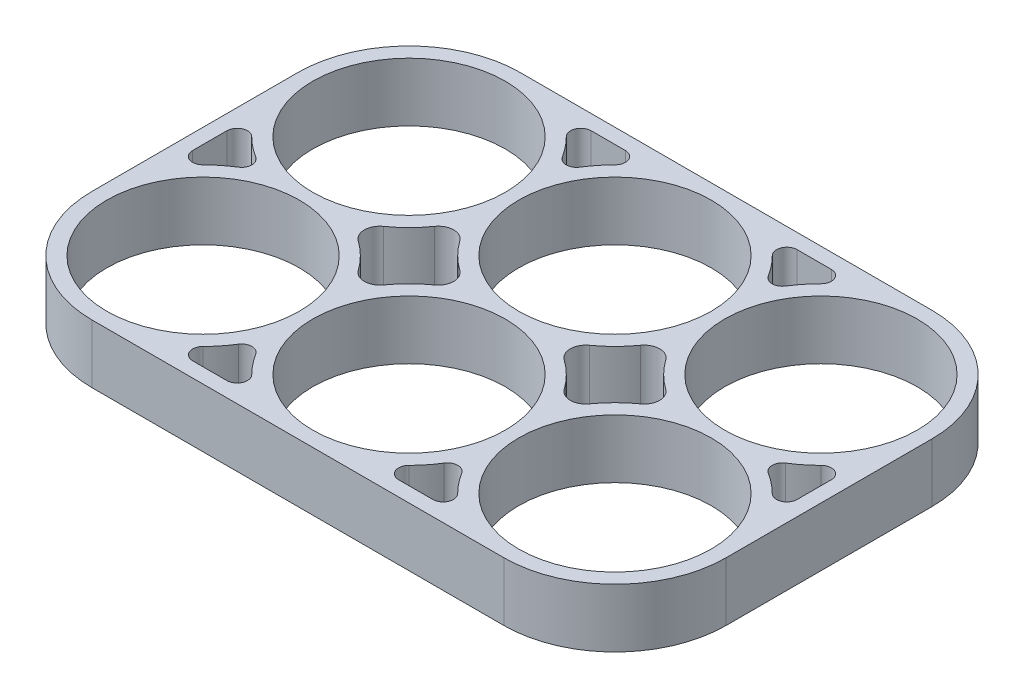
ISO-10303-21;
HEADER;
FILE_DESCRIPTION(('STEP AP214'),'2;1');
FILE_NAME('part.step','',(''),(''),'','','');
FILE_SCHEMA(('AUTOMOTIVE_DESIGN { 1 0 10303 214 1 1 1 1 }'));
ENDSEC;
DATA;
#1=APPLICATION_CONTEXT('core data for automotive mechanical design processes');
#2=APPLICATION_PROTOCOL_DEFINITION('international standard','automotive_design',2000,#1);
#3=PRODUCT_CONTEXT('',#1,'mechanical');
#4=PRODUCT('Part','Part','',(#3));
#5=PRODUCT_RELATED_PRODUCT_CATEGORY('part','',(#4));
#6=PRODUCT_DEFINITION_FORMATION('','',#4);
#7=PRODUCT_DEFINITION_CONTEXT('part definition',#1,'design');
#8=PRODUCT_DEFINITION('design','',#6,#7);
#9=PRODUCT_DEFINITION_SHAPE('','',#8);
#10=(LENGTH_UNIT() NAMED_UNIT(*) SI_UNIT(.MILLI.,.METRE.));
#11=(NAMED_UNIT(*) PLANE_ANGLE_UNIT() SI_UNIT($,.RADIAN.));
#12=(NAMED_UNIT(*) SI_UNIT($,.STERADIAN.) SOLID_ANGLE_UNIT());
#13=UNCERTAINTY_MEASURE_WITH_UNIT(LENGTH_MEASURE(1.E-05),#10,'distance_accuracy_value','');
#14=(GEOMETRIC_REPRESENTATION_CONTEXT(3) GLOBAL_UNCERTAINTY_ASSIGNED_CONTEXT((#13)) GLOBAL_UNIT_ASSIGNED_CONTEXT((#10,
#11,#12)) REPRESENTATION_CONTEXT('',''));
#15=CARTESIAN_POINT('',(0.,0.,0.));
#16=DIRECTION('',(0.,0.,1.));
#17=DIRECTION('',(1.,0.,0.));
#18=AXIS2_PLACEMENT_3D('',#15,#16,#17);
#19=CARTESIAN_POINT('',(-20.,5.7,-10.));
#20=DIRECTION('',(0.,1.,0.));
#21=DIRECTION('',(0.,0.,1.));
#22=AXIS2_PLACEMENT_3D('',#19,#20,#21);
#23=PLANE('',#22);
#24=CARTESIAN_POINT('',(0.,5.7,-10.));
#25=DIRECTION('',(0.,1.,0.));
#26=DIRECTION('',(0.,0.,1.));
#27=AXIS2_PLACEMENT_3D('',#24,#25,#26);
#28=CIRCLE('',#27,9.35);
#29=CARTESIAN_POINT('',(0.,5.7,-0.650000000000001));
#30=VERTEX_POINT('',#29);
#31=EDGE_CURVE('E818',#30,#30,#28,.T.);
#32=ORIENTED_EDGE('',*,*,#31,.F.);
#33=EDGE_LOOP('',(#32));
#34=FACE_BOUND('',#33,.T.);
#35=CARTESIAN_POINT('',(20.,5.7,10.));
#36=DIRECTION('',(0.,1.,0.));
#37=DIRECTION('',(0.,0.,1.));
#38=AXIS2_PLACEMENT_3D('',#35,#36,#37);
#39=CIRCLE('',#38,9.34999999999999);
#40=CARTESIAN_POINT('',(20.,5.7,19.35));
#41=VERTEX_POINT('',#40);
#42=EDGE_CURVE('E830',#41,#41,#39,.T.);
#43=ORIENTED_EDGE('',*,*,#42,.F.);
#44=EDGE_LOOP('',(#43));
#45=FACE_BOUND('',#44,.T.);
#46=CARTESIAN_POINT('',(-20.,5.7,10.));
#47=DIRECTION('',(0.,1.,0.));
#48=DIRECTION('',(0.,0.,1.));
#49=AXIS2_PLACEMENT_3D('',#46,#47,#48);
#50=CIRCLE('',#49,9.35);
#51=CARTESIAN_POINT('',(-20.,5.7,19.35));
#52=VERTEX_POINT('',#51);
#53=EDGE_CURVE('E842',#52,#52,#50,.T.);
#54=ORIENTED_EDGE('',*,*,#53,.F.);
#55=EDGE_LOOP('',(#54));
#56=FACE_BOUND('',#55,.T.);
#57=CARTESIAN_POINT('',(-20.,5.7,-10.));
#58=DIRECTION('',(0.,1.,0.));
#59=DIRECTION('',(0.,0.,1.));
#60=AXIS2_PLACEMENT_3D('',#57,#58,#59);
#61=CIRCLE('',#60,10.8);
#62=CARTESIAN_POINT('',(-20.,5.7,-20.8));
#63=VERTEX_POINT('',#62);
#64=CARTESIAN_POINT('',(-30.8,5.7,-9.99999999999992));
#65=VERTEX_POINT('',#64);
#66=EDGE_CURVE('E848',#63,#65,#61,.T.);
#67=ORIENTED_EDGE('',*,*,#66,.T.);
#68=DIRECTION('',(0.,0.,1.));
#69=VECTOR('',#68,1.);
#70=CARTESIAN_POINT('',(-30.8,5.7,-9.99999999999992));
#71=LINE('',#70,#69);
#72=CARTESIAN_POINT('',(-30.8,5.7,10.0000000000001));
#73=VERTEX_POINT('',#72);
#74=EDGE_CURVE('E851',#65,#73,#71,.T.);
#75=ORIENTED_EDGE('',*,*,#74,.T.);
#76=CARTESIAN_POINT('',(-20.,5.7,10.));
#77=DIRECTION('',(0.,1.,0.));
#78=DIRECTION('',(0.,0.,1.));
#79=AXIS2_PLACEMENT_3D('',#76,#77,#78);
#80=CIRCLE('',#79,10.8);
#81=CARTESIAN_POINT('',(-20.,5.7,20.8));
#82=VERTEX_POINT('',#81);
#83=EDGE_CURVE('E854',#73,#82,#80,.T.);
#84=ORIENTED_EDGE('',*,*,#83,.T.);
#85=DIRECTION('',(1.,0.,0.));
#86=VECTOR('',#85,1.);
#87=CARTESIAN_POINT('',(-19.9999999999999,5.7,20.8));
#88=LINE('',#87,#86);
#89=CARTESIAN_POINT('',(20.0000000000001,5.7,20.8));
#90=VERTEX_POINT('',#89);
#91=EDGE_CURVE('E856',#82,#90,#88,.T.);
#92=ORIENTED_EDGE('',*,*,#91,.T.);
#93=CARTESIAN_POINT('',(20.,5.7,10.));
#94=DIRECTION('',(0.,1.,0.));
#95=DIRECTION('',(0.,0.,1.));
#96=AXIS2_PLACEMENT_3D('',#93,#94,#95);
#97=CIRCLE('',#96,10.8);
#98=CARTESIAN_POINT('',(30.8,5.7,10.));
#99=VERTEX_POINT('',#98);
#100=EDGE_CURVE('E858',#90,#99,#97,.T.);
#101=ORIENTED_EDGE('',*,*,#100,.T.);
#102=DIRECTION('',(0.,0.,-1.));
#103=VECTOR('',#102,1.);
#104=CARTESIAN_POINT('',(30.8,5.7,-10.));
#105=LINE('',#104,#103);
#106=CARTESIAN_POINT('',(30.8,5.7,-10.));
#107=VERTEX_POINT('',#106);
#108=EDGE_CURVE('E860',#99,#107,#105,.T.);
#109=ORIENTED_EDGE('',*,*,#108,.T.);
#110=CARTESIAN_POINT('',(20.,5.7,-10.));
#111=DIRECTION('',(0.,1.,0.));
#112=DIRECTION('',(0.,0.,1.));
#113=AXIS2_PLACEMENT_3D('',#110,#111,#112);
#114=CIRCLE('',#113,10.8);
#115=CARTESIAN_POINT('',(20.,5.7,-20.8));
#116=VERTEX_POINT('',#115);
#117=EDGE_CURVE('E862',#107,#116,#114,.T.);
#118=ORIENTED_EDGE('',*,*,#117,.T.);
#119=DIRECTION('',(-1.,0.,0.));
#120=VECTOR('',#119,1.);
#121=CARTESIAN_POINT('',(-20.,5.7,-20.8));
#122=LINE('',#121,#120);
#123=EDGE_CURVE('E864',#116,#63,#122,.T.);
#124=ORIENTED_EDGE('',*,*,#123,.T.);
#125=EDGE_LOOP('',(#67,#75,#84,#92,#101,#109,#118,#124));
#126=FACE_BOUND('',#125,.T.);
#127=CARTESIAN_POINT('',(0.,5.7,10.));
#128=DIRECTION('',(0.,1.,0.));
#129=DIRECTION('',(0.,0.,1.));
#130=AXIS2_PLACEMENT_3D('',#127,#128,#129);
#131=CIRCLE('',#130,9.35);
#132=CARTESIAN_POINT('',(0.,5.7,19.35));
#133=VERTEX_POINT('',#132);
#134=EDGE_CURVE('E836',#133,#133,#131,.T.);
#135=ORIENTED_EDGE('',*,*,#134,.F.);
#136=EDGE_LOOP('',(#135));
#137=FACE_BOUND('',#136,.T.);
#138=CARTESIAN_POINT('',(20.,5.7,-10.));
#139=DIRECTION('',(0.,1.,0.));
#140=DIRECTION('',(0.,0.,1.));
#141=AXIS2_PLACEMENT_3D('',#138,#139,#140);
#142=CIRCLE('',#141,9.34999999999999);
#143=CARTESIAN_POINT('',(20.,5.7,-0.65000000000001));
#144=VERTEX_POINT('',#143);
#145=EDGE_CURVE('E824',#144,#144,#142,.T.);
#146=ORIENTED_EDGE('',*,*,#145,.F.);
#147=EDGE_LOOP('',(#146));
#148=FACE_BOUND('',#147,.T.);
#149=CARTESIAN_POINT('',(-20.,5.7,-10.));
#150=DIRECTION('',(0.,1.,0.));
#151=DIRECTION('',(0.,0.,1.));
#152=AXIS2_PLACEMENT_3D('',#149,#150,#151);
#153=CIRCLE('',#152,9.35);
#154=CARTESIAN_POINT('',(-20.,5.7,-0.650000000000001));
#155=VERTEX_POINT('',#154);
#156=EDGE_CURVE('E812',#155,#155,#153,.T.);
#157=ORIENTED_EDGE('',*,*,#156,.F.);
#158=EDGE_LOOP('',(#157));
#159=FACE_BOUND('',#158,.T.);
#160=CARTESIAN_POINT('',(20.,5.7,10.));
#161=DIRECTION('',(0.,-1.,0.));
#162=DIRECTION('',(0.,0.,1.));
#163=AXIS2_PLACEMENT_3D('',#160,#161,#162);
#164=CIRCLE('',#163,10.8);
#165=CARTESIAN_POINT('',(25.7333208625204,5.7,0.847457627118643));
#166=VERTEX_POINT('',#165);
#167=CARTESIAN_POINT('',(27.6423728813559,5.7,2.36887054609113));
#168=VERTEX_POINT('',#167);
#169=EDGE_CURVE('E769',#166,#168,#164,.T.);
#170=ORIENTED_EDGE('',*,*,#169,.F.);
#171=CARTESIAN_POINT('',(26.2641839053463,5.7,0.));
#172=DIRECTION('',(0.,1.,0.));
#173=DIRECTION('',(0.,0.,-1.));
#174=AXIS2_PLACEMENT_3D('',#171,#172,#173);
#175=CIRCLE('',#174,1.);
#176=CARTESIAN_POINT('',(25.7333208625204,5.7,-0.847457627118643));
#177=VERTEX_POINT('',#176);
#178=EDGE_CURVE('E767',#177,#166,#175,.T.);
#179=ORIENTED_EDGE('',*,*,#178,.F.);
#180=CARTESIAN_POINT('',(20.,5.7,-10.));
#181=DIRECTION('',(0.,-1.,0.));
#182=DIRECTION('',(0.,0.,1.));
#183=AXIS2_PLACEMENT_3D('',#180,#181,#182);
#184=CIRCLE('',#183,10.8);
#185=CARTESIAN_POINT('',(27.6423728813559,5.7,-2.36887054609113));
#186=VERTEX_POINT('',#185);
#187=EDGE_CURVE('E779',#186,#177,#184,.T.);
#188=ORIENTED_EDGE('',*,*,#187,.F.);
#189=CARTESIAN_POINT('',(28.35,5.7,-1.66228448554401));
#190=DIRECTION('',(0.,1.,0.));
#191=DIRECTION('',(0.,0.,1.));
#192=AXIS2_PLACEMENT_3D('',#189,#190,#191);
#193=CIRCLE('',#192,1.);
#194=CARTESIAN_POINT('',(29.35,5.7,-1.66228448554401));
#195=VERTEX_POINT('',#194);
#196=EDGE_CURVE('E776',#195,#186,#193,.T.);
#197=ORIENTED_EDGE('',*,*,#196,.F.);
#198=DIRECTION('',(0.,0.,-1.));
#199=VECTOR('',#198,1.);
#200=CARTESIAN_POINT('',(29.35,5.7,-1.66228448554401));
#201=LINE('',#200,#199);
#202=CARTESIAN_POINT('',(29.35,5.7,1.66228448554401));
#203=VERTEX_POINT('',#202);
#204=EDGE_CURVE('E774',#203,#195,#201,.T.);
#205=ORIENTED_EDGE('',*,*,#204,.F.);
#206=CARTESIAN_POINT('',(28.35,5.7,1.66228448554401));
#207=DIRECTION('',(0.,1.,0.));
#208=DIRECTION('',(0.,0.,1.));
#209=AXIS2_PLACEMENT_3D('',#206,#207,#208);
#210=CIRCLE('',#209,1.);
#211=EDGE_CURVE('E772',#168,#203,#210,.T.);
#212=ORIENTED_EDGE('',*,*,#211,.F.);
#213=EDGE_LOOP('',(#170,#179,#188,#197,#205,#212));
#214=FACE_BOUND('',#213,.T.);
#215=DIRECTION('',(0.,0.,1.));
#216=VECTOR('',#215,1.);
#217=CARTESIAN_POINT('',(-29.35,5.7,-1.66228448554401));
#218=LINE('',#217,#216);
#219=CARTESIAN_POINT('',(-29.35,5.7,-1.66228448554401));
#220=VERTEX_POINT('',#219);
#221=CARTESIAN_POINT('',(-29.35,5.7,1.66228448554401));
#222=VERTEX_POINT('',#221);
#223=EDGE_CURVE('E724',#220,#222,#218,.T.);
#224=ORIENTED_EDGE('',*,*,#223,.F.);
#225=CARTESIAN_POINT('',(-28.35,5.7,-1.66228448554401));
#226=DIRECTION('',(0.,1.,0.));
#227=DIRECTION('',(0.,0.,-1.));
#228=AXIS2_PLACEMENT_3D('',#225,#226,#227);
#229=CIRCLE('',#228,1.);
#230=CARTESIAN_POINT('',(-27.6423728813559,5.7,-2.36887054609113));
#231=VERTEX_POINT('',#230);
#232=EDGE_CURVE('E722',#231,#220,#229,.T.);
#233=ORIENTED_EDGE('',*,*,#232,.F.);
#234=CARTESIAN_POINT('',(-20.,5.7,-10.));
#235=DIRECTION('',(0.,-1.,0.));
#236=DIRECTION('',(0.,0.,1.));
#237=AXIS2_PLACEMENT_3D('',#234,#235,#236);
#238=CIRCLE('',#237,10.8);
#239=CARTESIAN_POINT('',(-25.7333208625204,5.7,-0.847457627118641));
#240=VERTEX_POINT('',#239);
#241=EDGE_CURVE('E734',#240,#231,#238,.T.);
#242=ORIENTED_EDGE('',*,*,#241,.F.);
#243=CARTESIAN_POINT('',(-26.2641839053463,5.7,0.));
#244=DIRECTION('',(0.,1.,0.));
#245=DIRECTION('',(0.,0.,1.));
#246=AXIS2_PLACEMENT_3D('',#243,#244,#245);
#247=CIRCLE('',#246,1.);
#248=CARTESIAN_POINT('',(-25.7333208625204,5.7,0.847457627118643));
#249=VERTEX_POINT('',#248);
#250=EDGE_CURVE('E731',#249,#240,#247,.T.);
#251=ORIENTED_EDGE('',*,*,#250,.F.);
#252=CARTESIAN_POINT('',(-20.,5.7,10.));
#253=DIRECTION('',(0.,-1.,0.));
#254=DIRECTION('',(0.,0.,1.));
#255=AXIS2_PLACEMENT_3D('',#252,#253,#254);
#256=CIRCLE('',#255,10.8);
#257=CARTESIAN_POINT('',(-27.6423728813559,5.7,2.36887054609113));
#258=VERTEX_POINT('',#257);
#259=EDGE_CURVE('E729',#258,#249,#256,.T.);
#260=ORIENTED_EDGE('',*,*,#259,.F.);
#261=CARTESIAN_POINT('',(-28.35,5.7,1.66228448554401));
#262=DIRECTION('',(0.,1.,0.));
#263=DIRECTION('',(0.,0.,-1.));
#264=AXIS2_PLACEMENT_3D('',#261,#262,#263);
#265=CIRCLE('',#264,1.);
#266=EDGE_CURVE('E727',#222,#258,#265,.T.);
#267=ORIENTED_EDGE('',*,*,#266,.F.);
#268=EDGE_LOOP('',(#224,#233,#242,#251,#260,#267));
#269=FACE_BOUND('',#268,.T.);
#270=DIRECTION('',(1.,0.,0.));
#271=VECTOR('',#270,1.);
#272=CARTESIAN_POINT('',(-11.662284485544,5.7,19.35));
#273=LINE('',#272,#271);
#274=CARTESIAN_POINT('',(-11.662284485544,5.7,19.35));
#275=VERTEX_POINT('',#274);
#276=CARTESIAN_POINT('',(-8.33771551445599,5.7,19.35));
#277=VERTEX_POINT('',#276);
#278=EDGE_CURVE('E679',#275,#277,#273,.T.);
#279=ORIENTED_EDGE('',*,*,#278,.F.);
#280=CARTESIAN_POINT('',(-11.662284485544,5.7,18.35));
#281=DIRECTION('',(0.,1.,0.));
#282=DIRECTION('',(0.,0.,-1.));
#283=AXIS2_PLACEMENT_3D('',#280,#281,#282);
#284=CIRCLE('',#283,1.);
#285=CARTESIAN_POINT('',(-12.3688705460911,5.7,17.6423728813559));
#286=VERTEX_POINT('',#285);
#287=EDGE_CURVE('E677',#286,#275,#284,.T.);
#288=ORIENTED_EDGE('',*,*,#287,.F.);
#289=CARTESIAN_POINT('',(-20.,5.7,10.));
#290=DIRECTION('',(0.,-1.,0.));
#291=DIRECTION('',(0.,0.,1.));
#292=AXIS2_PLACEMENT_3D('',#289,#290,#291);
#293=CIRCLE('',#292,10.8);
#294=CARTESIAN_POINT('',(-10.8474576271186,5.7,15.7333208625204));
#295=VERTEX_POINT('',#294);
#296=EDGE_CURVE('E689',#295,#286,#293,.T.);
#297=ORIENTED_EDGE('',*,*,#296,.F.);
#298=CARTESIAN_POINT('',(-10.,5.7,16.2641839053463));
#299=DIRECTION('',(0.,1.,0.));
#300=DIRECTION('',(0.,0.,1.));
#301=AXIS2_PLACEMENT_3D('',#298,#299,#300);
#302=CIRCLE('',#301,1.);
#303=CARTESIAN_POINT('',(-9.15254237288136,5.7,15.7333208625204));
#304=VERTEX_POINT('',#303);
#305=EDGE_CURVE('E686',#304,#295,#302,.T.);
#306=ORIENTED_EDGE('',*,*,#305,.F.);
#307=CARTESIAN_POINT('',(0.,5.7,10.));
#308=DIRECTION('',(0.,-1.,0.));
#309=DIRECTION('',(0.,0.,1.));
#310=AXIS2_PLACEMENT_3D('',#307,#308,#309);
#311=CIRCLE('',#310,10.8);
#312=CARTESIAN_POINT('',(-7.63112945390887,5.7,17.6423728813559));
#313=VERTEX_POINT('',#312);
#314=EDGE_CURVE('E684',#313,#304,#311,.T.);
#315=ORIENTED_EDGE('',*,*,#314,.F.);
#316=CARTESIAN_POINT('',(-8.33771551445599,5.7,18.35));
#317=DIRECTION('',(0.,1.,0.));
#318=DIRECTION('',(0.,0.,1.));
#319=AXIS2_PLACEMENT_3D('',#316,#317,#318);
#320=CIRCLE('',#319,1.);
#321=EDGE_CURVE('E682',#277,#313,#320,.T.);
#322=ORIENTED_EDGE('',*,*,#321,.F.);
#323=EDGE_LOOP('',(#279,#288,#297,#306,#315,#322));
#324=FACE_BOUND('',#323,.T.);
#325=CARTESIAN_POINT('',(20.,5.7,10.));
#326=DIRECTION('',(0.,-1.,0.));
#327=DIRECTION('',(0.,0.,1.));
#328=AXIS2_PLACEMENT_3D('',#325,#326,#327);
#329=CIRCLE('',#328,10.8);
#330=CARTESIAN_POINT('',(12.3688705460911,5.7,17.6423728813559));
#331=VERTEX_POINT('',#330);
#332=CARTESIAN_POINT('',(10.8474576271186,5.7,15.7333208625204));
#333=VERTEX_POINT('',#332);
#334=EDGE_CURVE('E634',#331,#333,#329,.T.);
#335=ORIENTED_EDGE('',*,*,#334,.F.);
#336=CARTESIAN_POINT('',(11.662284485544,5.7,18.35));
#337=DIRECTION('',(0.,1.,0.));
#338=DIRECTION('',(0.,0.,1.));
#339=AXIS2_PLACEMENT_3D('',#336,#337,#338);
#340=CIRCLE('',#339,1.);
#341=CARTESIAN_POINT('',(11.662284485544,5.7,19.35));
#342=VERTEX_POINT('',#341);
#343=EDGE_CURVE('E632',#342,#331,#340,.T.);
#344=ORIENTED_EDGE('',*,*,#343,.F.);
#345=DIRECTION('',(1.,0.,0.));
#346=VECTOR('',#345,1.);
#347=CARTESIAN_POINT('',(8.33771551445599,5.7,19.35));
#348=LINE('',#347,#346);
#349=CARTESIAN_POINT('',(8.33771551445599,5.7,19.35));
#350=VERTEX_POINT('',#349);
#351=EDGE_CURVE('E644',#350,#342,#348,.T.);
#352=ORIENTED_EDGE('',*,*,#351,.F.);
#353=CARTESIAN_POINT('',(8.33771551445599,5.7,18.35));
#354=DIRECTION('',(0.,1.,0.));
#355=DIRECTION('',(0.,0.,-1.));
#356=AXIS2_PLACEMENT_3D('',#353,#354,#355);
#357=CIRCLE('',#356,1.);
#358=CARTESIAN_POINT('',(7.63112945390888,5.7,17.6423728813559));
#359=VERTEX_POINT('',#358);
#360=EDGE_CURVE('E641',#359,#350,#357,.T.);
#361=ORIENTED_EDGE('',*,*,#360,.F.);
#362=CARTESIAN_POINT('',(0.,5.7,10.));
#363=DIRECTION('',(0.,-1.,0.));
#364=DIRECTION('',(0.,0.,1.));
#365=AXIS2_PLACEMENT_3D('',#362,#363,#364);
#366=CIRCLE('',#365,10.8);
#367=CARTESIAN_POINT('',(9.15254237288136,5.7,15.7333208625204));
#368=VERTEX_POINT('',#367);
#369=EDGE_CURVE('E639',#368,#359,#366,.T.);
#370=ORIENTED_EDGE('',*,*,#369,.F.);
#371=CARTESIAN_POINT('',(10.,5.7,16.2641839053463));
#372=DIRECTION('',(0.,1.,0.));
#373=DIRECTION('',(0.,0.,-1.));
#374=AXIS2_PLACEMENT_3D('',#371,#372,#373);
#375=CIRCLE('',#374,1.);
#376=EDGE_CURVE('E637',#333,#368,#375,.T.);
#377=ORIENTED_EDGE('',*,*,#376,.F.);
#378=EDGE_LOOP('',(#335,#344,#352,#361,#370,#377));
#379=FACE_BOUND('',#378,.T.);
#380=CARTESIAN_POINT('',(20.,5.7,-10.));
#381=DIRECTION('',(0.,-1.,0.));
#382=DIRECTION('',(0.,0.,1.));
#383=AXIS2_PLACEMENT_3D('',#380,#381,#382);
#384=CIRCLE('',#383,10.8);
#385=CARTESIAN_POINT('',(10.8474576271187,5.7,-15.7333208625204));
#386=VERTEX_POINT('',#385);
#387=CARTESIAN_POINT('',(12.3688705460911,5.7,-17.6423728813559));
#388=VERTEX_POINT('',#387);
#389=EDGE_CURVE('E589',#386,#388,#384,.T.);
#390=ORIENTED_EDGE('',*,*,#389,.F.);
#391=CARTESIAN_POINT('',(10.,5.7,-16.2641839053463));
#392=DIRECTION('',(0.,1.,0.));
#393=DIRECTION('',(0.,0.,1.));
#394=AXIS2_PLACEMENT_3D('',#391,#392,#393);
#395=CIRCLE('',#394,1.);
#396=CARTESIAN_POINT('',(9.15254237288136,5.7,-15.7333208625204));
#397=VERTEX_POINT('',#396);
#398=EDGE_CURVE('E587',#397,#386,#395,.T.);
#399=ORIENTED_EDGE('',*,*,#398,.F.);
#400=CARTESIAN_POINT('',(0.,5.7,-10.));
#401=DIRECTION('',(0.,-1.,0.));
#402=DIRECTION('',(0.,0.,1.));
#403=AXIS2_PLACEMENT_3D('',#400,#401,#402);
#404=CIRCLE('',#403,10.8);
#405=CARTESIAN_POINT('',(7.63112945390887,5.7,-17.6423728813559));
#406=VERTEX_POINT('',#405);
#407=EDGE_CURVE('E599',#406,#397,#404,.T.);
#408=ORIENTED_EDGE('',*,*,#407,.F.);
#409=CARTESIAN_POINT('',(8.33771551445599,5.7,-18.35));
#410=DIRECTION('',(0.,1.,0.));
#411=DIRECTION('',(0.,0.,-1.));
#412=AXIS2_PLACEMENT_3D('',#409,#410,#411);
#413=CIRCLE('',#412,1.);
#414=CARTESIAN_POINT('',(8.33771551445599,5.7,-19.35));
#415=VERTEX_POINT('',#414);
#416=EDGE_CURVE('E596',#415,#406,#413,.T.);
#417=ORIENTED_EDGE('',*,*,#416,.F.);
#418=DIRECTION('',(-1.,0.,0.));
#419=VECTOR('',#418,1.);
#420=CARTESIAN_POINT('',(8.33771551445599,5.7,-19.35));
#421=LINE('',#420,#419);
#422=CARTESIAN_POINT('',(11.662284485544,5.7,-19.35));
#423=VERTEX_POINT('',#422);
#424=EDGE_CURVE('E594',#423,#415,#421,.T.);
#425=ORIENTED_EDGE('',*,*,#424,.F.);
#426=CARTESIAN_POINT('',(11.662284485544,5.7,-18.35));
#427=DIRECTION('',(0.,1.,0.));
#428=DIRECTION('',(0.,0.,1.));
#429=AXIS2_PLACEMENT_3D('',#426,#427,#428);
#430=CIRCLE('',#429,1.);
#431=EDGE_CURVE('E592',#388,#423,#430,.T.);
#432=ORIENTED_EDGE('',*,*,#431,.F.);
#433=EDGE_LOOP('',(#390,#399,#408,#417,#425,#432));
#434=FACE_BOUND('',#433,.T.);
#435=CARTESIAN_POINT('',(0.,5.7,-10.));
#436=DIRECTION('',(0.,-1.,0.));
#437=DIRECTION('',(0.,0.,1.));
#438=AXIS2_PLACEMENT_3D('',#435,#436,#437);
#439=CIRCLE('',#438,10.8);
#440=CARTESIAN_POINT('',(-9.15254237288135,5.7,-15.7333208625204));
#441=VERTEX_POINT('',#440);
#442=CARTESIAN_POINT('',(-7.63112945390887,5.7,-17.6423728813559));
#443=VERTEX_POINT('',#442);
#444=EDGE_CURVE('E544',#441,#443,#439,.T.);
#445=ORIENTED_EDGE('',*,*,#444,.F.);
#446=CARTESIAN_POINT('',(-10.,5.7,-16.2641839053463));
#447=DIRECTION('',(0.,1.,0.));
#448=DIRECTION('',(0.,0.,1.));
#449=AXIS2_PLACEMENT_3D('',#446,#447,#448);
#450=CIRCLE('',#449,1.);
#451=CARTESIAN_POINT('',(-10.8474576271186,5.7,-15.7333208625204));
#452=VERTEX_POINT('',#451);
#453=EDGE_CURVE('E542',#452,#441,#450,.T.);
#454=ORIENTED_EDGE('',*,*,#453,.F.);
#455=CARTESIAN_POINT('',(-20.,5.7,-10.));
#456=DIRECTION('',(0.,-1.,0.));
#457=DIRECTION('',(0.,0.,1.));
#458=AXIS2_PLACEMENT_3D('',#455,#456,#457);
#459=CIRCLE('',#458,10.8);
#460=CARTESIAN_POINT('',(-12.3688705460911,5.7,-17.6423728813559));
#461=VERTEX_POINT('',#460);
#462=EDGE_CURVE('E554',#461,#452,#459,.T.);
#463=ORIENTED_EDGE('',*,*,#462,.F.);
#464=CARTESIAN_POINT('',(-11.662284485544,5.7,-18.35));
#465=DIRECTION('',(0.,1.,0.));
#466=DIRECTION('',(0.,0.,1.));
#467=AXIS2_PLACEMENT_3D('',#464,#465,#466);
#468=CIRCLE('',#467,1.);
#469=CARTESIAN_POINT('',(-11.662284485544,5.7,-19.35));
#470=VERTEX_POINT('',#469);
#471=EDGE_CURVE('E551',#470,#461,#468,.T.);
#472=ORIENTED_EDGE('',*,*,#471,.F.);
#473=DIRECTION('',(-1.,0.,0.));
#474=VECTOR('',#473,1.);
#475=CARTESIAN_POINT('',(-11.662284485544,5.7,-19.35));
#476=LINE('',#475,#474);
#477=CARTESIAN_POINT('',(-8.33771551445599,5.7,-19.35));
#478=VERTEX_POINT('',#477);
#479=EDGE_CURVE('E549',#478,#470,#476,.T.);
#480=ORIENTED_EDGE('',*,*,#479,.F.);
#481=CARTESIAN_POINT('',(-8.33771551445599,5.7,-18.35));
#482=DIRECTION('',(0.,1.,0.));
#483=DIRECTION('',(0.,0.,1.));
#484=AXIS2_PLACEMENT_3D('',#481,#482,#483);
#485=CIRCLE('',#484,1.);
#486=EDGE_CURVE('E547',#443,#478,#485,.T.);
#487=ORIENTED_EDGE('',*,*,#486,.F.);
#488=EDGE_LOOP('',(#445,#454,#463,#472,#480,#487));
#489=FACE_BOUND('',#488,.T.);
#490=CARTESIAN_POINT('',(0.,5.7,10.));
#491=DIRECTION('',(0.,-1.,0.));
#492=DIRECTION('',(0.,0.,1.));
#493=AXIS2_PLACEMENT_3D('',#490,#491,#492);
#494=CIRCLE('',#493,10.8);
#495=CARTESIAN_POINT('',(6.288325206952,5.7,1.21951219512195));
#496=VERTEX_POINT('',#495);
#497=CARTESIAN_POINT('',(8.78048780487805,5.7,3.711674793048));
#498=VERTEX_POINT('',#497);
#499=EDGE_CURVE('E485',#496,#498,#494,.T.);
#500=ORIENTED_EDGE('',*,*,#499,.F.);
#501=CARTESIAN_POINT('',(7.16170370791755,5.7,0.));
#502=DIRECTION('',(0.,1.,0.));
#503=DIRECTION('',(0.,0.,-1.));
#504=AXIS2_PLACEMENT_3D('',#501,#502,#503);
#505=CIRCLE('',#504,1.5);
#506=CARTESIAN_POINT('',(6.288325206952,5.7,-1.21951219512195));
#507=VERTEX_POINT('',#506);
#508=EDGE_CURVE('E483',#507,#496,#505,.T.);
#509=ORIENTED_EDGE('',*,*,#508,.F.);
#510=CARTESIAN_POINT('',(0.,5.7,-10.));
#511=DIRECTION('',(0.,-1.,0.));
#512=DIRECTION('',(0.,0.,1.));
#513=AXIS2_PLACEMENT_3D('',#510,#511,#512);
#514=CIRCLE('',#513,10.8);
#515=CARTESIAN_POINT('',(8.78048780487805,5.7,-3.71167479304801));
#516=VERTEX_POINT('',#515);
#517=EDGE_CURVE('E499',#516,#507,#514,.T.);
#518=ORIENTED_EDGE('',*,*,#517,.F.);
#519=CARTESIAN_POINT('',(10.,5.7,-2.83829629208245));
#520=DIRECTION('',(0.,1.,0.));
#521=DIRECTION('',(0.,0.,1.));
#522=AXIS2_PLACEMENT_3D('',#519,#520,#521);
#523=CIRCLE('',#522,1.5);
#524=CARTESIAN_POINT('',(11.2195121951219,5.7,-3.71167479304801));
#525=VERTEX_POINT('',#524);
#526=EDGE_CURVE('E496',#525,#516,#523,.T.);
#527=ORIENTED_EDGE('',*,*,#526,.F.);
#528=CARTESIAN_POINT('',(20.,5.7,-10.));
#529=DIRECTION('',(0.,-1.,0.));
#530=DIRECTION('',(0.,0.,1.));
#531=AXIS2_PLACEMENT_3D('',#528,#529,#530);
#532=CIRCLE('',#531,10.8);
#533=CARTESIAN_POINT('',(13.711674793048,5.7,-1.21951219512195));
#534=VERTEX_POINT('',#533);
#535=EDGE_CURVE('E494',#534,#525,#532,.T.);
#536=ORIENTED_EDGE('',*,*,#535,.F.);
#537=CARTESIAN_POINT('',(12.8382962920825,5.7,0.));
#538=DIRECTION('',(0.,1.,0.));
#539=DIRECTION('',(0.,0.,1.));
#540=AXIS2_PLACEMENT_3D('',#537,#538,#539);
#541=CIRCLE('',#540,1.5);
#542=CARTESIAN_POINT('',(13.711674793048,5.7,1.21951219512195));
#543=VERTEX_POINT('',#542);
#544=EDGE_CURVE('E492',#543,#534,#541,.T.);
#545=ORIENTED_EDGE('',*,*,#544,.F.);
#546=CARTESIAN_POINT('',(20.,5.7,10.));
#547=DIRECTION('',(0.,-1.,0.));
#548=DIRECTION('',(0.,0.,1.));
#549=AXIS2_PLACEMENT_3D('',#546,#547,#548);
#550=CIRCLE('',#549,10.8);
#551=CARTESIAN_POINT('',(11.219512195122,5.7,3.711674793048));
#552=VERTEX_POINT('',#551);
#553=EDGE_CURVE('E490',#552,#543,#550,.T.);
#554=ORIENTED_EDGE('',*,*,#553,.F.);
#555=CARTESIAN_POINT('',(10.,5.7,2.83829629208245));
#556=DIRECTION('',(0.,1.,0.));
#557=DIRECTION('',(0.,0.,1.));
#558=AXIS2_PLACEMENT_3D('',#555,#556,#557);
#559=CIRCLE('',#558,1.5);
#560=EDGE_CURVE('E488',#498,#552,#559,.T.);
#561=ORIENTED_EDGE('',*,*,#560,.F.);
#562=EDGE_LOOP('',(#500,#509,#518,#527,#536,#545,#554,#561));
#563=FACE_BOUND('',#562,.T.);
#564=CARTESIAN_POINT('',(-20.,5.7,10.));
#565=DIRECTION('',(0.,-1.,0.));
#566=DIRECTION('',(0.,0.,1.));
#567=AXIS2_PLACEMENT_3D('',#564,#565,#566);
#568=CIRCLE('',#567,10.8);
#569=CARTESIAN_POINT('',(-13.711674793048,5.7,1.21951219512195));
#570=VERTEX_POINT('',#569);
#571=CARTESIAN_POINT('',(-11.2195121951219,5.7,3.711674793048));
#572=VERTEX_POINT('',#571);
#573=EDGE_CURVE('E426',#570,#572,#568,.T.);
#574=ORIENTED_EDGE('',*,*,#573,.F.);
#575=CARTESIAN_POINT('',(-12.8382962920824,5.7,0.));
#576=DIRECTION('',(0.,1.,0.));
#577=DIRECTION('',(0.,0.,-1.));
#578=AXIS2_PLACEMENT_3D('',#575,#576,#577);
#579=CIRCLE('',#578,1.5);
#580=CARTESIAN_POINT('',(-13.711674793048,5.7,-1.21951219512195));
#581=VERTEX_POINT('',#580);
#582=EDGE_CURVE('E418',#581,#570,#579,.T.);
#583=ORIENTED_EDGE('',*,*,#582,.F.);
#584=CARTESIAN_POINT('',(-20.,5.7,-10.));
#585=DIRECTION('',(0.,-1.,0.));
#586=DIRECTION('',(0.,0.,1.));
#587=AXIS2_PLACEMENT_3D('',#584,#585,#586);
#588=CIRCLE('',#587,10.8);
#589=CARTESIAN_POINT('',(-11.219512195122,5.7,-3.711674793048));
#590=VERTEX_POINT('',#589);
#591=EDGE_CURVE('E451',#590,#581,#588,.T.);
#592=ORIENTED_EDGE('',*,*,#591,.F.);
#593=CARTESIAN_POINT('',(-10.,5.7,-2.83829629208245));
#594=DIRECTION('',(0.,1.,0.));
#595=DIRECTION('',(0.,0.,1.));
#596=AXIS2_PLACEMENT_3D('',#593,#594,#595);
#597=CIRCLE('',#596,1.5);
#598=CARTESIAN_POINT('',(-8.78048780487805,5.7,-3.71167479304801));
#599=VERTEX_POINT('',#598);
#600=EDGE_CURVE('E449',#599,#590,#597,.T.);
#601=ORIENTED_EDGE('',*,*,#600,.F.);
#602=CARTESIAN_POINT('',(0.,5.7,-10.));
#603=DIRECTION('',(0.,-1.,0.));
#604=DIRECTION('',(0.,0.,1.));
#605=AXIS2_PLACEMENT_3D('',#602,#603,#604);
#606=CIRCLE('',#605,10.8);
#607=CARTESIAN_POINT('',(-6.288325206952,5.7,-1.21951219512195));
#608=VERTEX_POINT('',#607);
#609=EDGE_CURVE('E447',#608,#599,#606,.T.);
#610=ORIENTED_EDGE('',*,*,#609,.F.);
#611=CARTESIAN_POINT('',(-7.16170370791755,5.7,0.));
#612=DIRECTION('',(0.,1.,0.));
#613=DIRECTION('',(0.,0.,1.));
#614=AXIS2_PLACEMENT_3D('',#611,#612,#613);
#615=CIRCLE('',#614,1.5);
#616=CARTESIAN_POINT('',(-6.28832520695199,5.7,1.21951219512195));
#617=VERTEX_POINT('',#616);
#618=EDGE_CURVE('E445',#617,#608,#615,.T.);
#619=ORIENTED_EDGE('',*,*,#618,.F.);
#620=CARTESIAN_POINT('',(0.,5.7,10.));
#621=DIRECTION('',(0.,-1.,0.));
#622=DIRECTION('',(0.,0.,1.));
#623=AXIS2_PLACEMENT_3D('',#620,#621,#622);
#624=CIRCLE('',#623,10.8);
#625=CARTESIAN_POINT('',(-8.78048780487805,5.7,3.711674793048));
#626=VERTEX_POINT('',#625);
#627=EDGE_CURVE('E441',#626,#617,#624,.T.);
#628=ORIENTED_EDGE('',*,*,#627,.F.);
#629=CARTESIAN_POINT('',(-10.,5.7,2.83829629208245));
#630=DIRECTION('',(0.,1.,0.));
#631=DIRECTION('',(0.,0.,1.));
#632=AXIS2_PLACEMENT_3D('',#629,#630,#631);
#633=CIRCLE('',#632,1.5);
#634=EDGE_CURVE('E439',#572,#626,#633,.T.);
#635=ORIENTED_EDGE('',*,*,#634,.F.);
#636=EDGE_LOOP('',(#574,#583,#592,#601,#610,#619,#628,#635));
#637=FACE_BOUND('',#636,.T.);
#638=ADVANCED_FACE('F41',(#34,#45,#56,#126,#137,#148,#159,#214,#269,#324,#379,#434,#489,#563,
#637),#23,.T.);
#639=CARTESIAN_POINT('',(-20.,0.,-10.));
#640=DIRECTION('',(0.,1.,0.));
#641=DIRECTION('',(0.,0.,1.));
#642=AXIS2_PLACEMENT_3D('',#639,#640,#641);
#643=PLANE('',#642);
#644=CARTESIAN_POINT('',(7.16170370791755,0.,0.));
#645=DIRECTION('',(0.,1.,0.));
#646=DIRECTION('',(0.,0.,-1.));
#647=AXIS2_PLACEMENT_3D('',#644,#645,#646);
#648=CIRCLE('',#647,1.5);
#649=CARTESIAN_POINT('',(6.288325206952,0.,-1.21951219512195));
#650=VERTEX_POINT('',#649);
#651=CARTESIAN_POINT('',(6.288325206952,0.,1.21951219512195));
#652=VERTEX_POINT('',#651);
#653=EDGE_CURVE('E434',#650,#652,#648,.T.);
#654=ORIENTED_EDGE('',*,*,#653,.T.);
#655=CARTESIAN_POINT('',(0.,0.,10.));
#656=DIRECTION('',(0.,-1.,0.));
#657=DIRECTION('',(0.,0.,1.));
#658=AXIS2_PLACEMENT_3D('',#655,#656,#657);
#659=CIRCLE('',#658,10.8);
#660=CARTESIAN_POINT('',(8.78048780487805,0.,3.711674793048));
#661=VERTEX_POINT('',#660);
#662=EDGE_CURVE('E504',#652,#661,#659,.T.);
#663=ORIENTED_EDGE('',*,*,#662,.T.);
#664=CARTESIAN_POINT('',(10.,0.,2.83829629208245));
#665=DIRECTION('',(0.,1.,0.));
#666=DIRECTION('',(0.,0.,1.));
#667=AXIS2_PLACEMENT_3D('',#664,#665,#666);
#668=CIRCLE('',#667,1.5);
#669=CARTESIAN_POINT('',(11.219512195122,0.,3.711674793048));
#670=VERTEX_POINT('',#669);
#671=EDGE_CURVE('E507',#661,#670,#668,.T.);
#672=ORIENTED_EDGE('',*,*,#671,.T.);
#673=CARTESIAN_POINT('',(20.,0.,10.));
#674=DIRECTION('',(0.,-1.,0.));
#675=DIRECTION('',(0.,0.,1.));
#676=AXIS2_PLACEMENT_3D('',#673,#674,#675);
#677=CIRCLE('',#676,10.8);
#678=CARTESIAN_POINT('',(13.711674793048,0.,1.21951219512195));
#679=VERTEX_POINT('',#678);
#680=EDGE_CURVE('E510',#670,#679,#677,.T.);
#681=ORIENTED_EDGE('',*,*,#680,.T.);
#682=CARTESIAN_POINT('',(12.8382962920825,0.,0.));
#683=DIRECTION('',(0.,1.,0.));
#684=DIRECTION('',(0.,0.,1.));
#685=AXIS2_PLACEMENT_3D('',#682,#683,#684);
#686=CIRCLE('',#685,1.5);
#687=CARTESIAN_POINT('',(13.711674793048,0.,-1.21951219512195));
#688=VERTEX_POINT('',#687);
#689=EDGE_CURVE('E513',#679,#688,#686,.T.);
#690=ORIENTED_EDGE('',*,*,#689,.T.);
#691=CARTESIAN_POINT('',(20.,0.,-10.));
#692=DIRECTION('',(0.,-1.,0.));
#693=DIRECTION('',(0.,0.,1.));
#694=AXIS2_PLACEMENT_3D('',#691,#692,#693);
#695=CIRCLE('',#694,10.8);
#696=CARTESIAN_POINT('',(11.2195121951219,0.,-3.71167479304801));
#697=VERTEX_POINT('',#696);
#698=EDGE_CURVE('E516',#688,#697,#695,.T.);
#699=ORIENTED_EDGE('',*,*,#698,.T.);
#700=CARTESIAN_POINT('',(10.,0.,-2.83829629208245));
#701=DIRECTION('',(0.,1.,0.));
#702=DIRECTION('',(0.,0.,1.));
#703=AXIS2_PLACEMENT_3D('',#700,#701,#702);
#704=CIRCLE('',#703,1.5);
#705=CARTESIAN_POINT('',(8.78048780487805,0.,-3.711674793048));
#706=VERTEX_POINT('',#705);
#707=EDGE_CURVE('E519',#697,#706,#704,.T.);
#708=ORIENTED_EDGE('',*,*,#707,.T.);
#709=CARTESIAN_POINT('',(0.,0.,-10.));
#710=DIRECTION('',(0.,-1.,0.));
#711=DIRECTION('',(0.,0.,1.));
#712=AXIS2_PLACEMENT_3D('',#709,#710,#711);
#713=CIRCLE('',#712,10.8);
#714=EDGE_CURVE('E486',#706,#650,#713,.T.);
#715=ORIENTED_EDGE('',*,*,#714,.T.);
#716=EDGE_LOOP('',(#654,#663,#672,#681,#690,#699,#708,#715));
#717=FACE_BOUND('',#716,.T.);
#718=CARTESIAN_POINT('',(10.,0.,-16.2641839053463));
#719=DIRECTION('',(0.,1.,0.));
#720=DIRECTION('',(0.,0.,1.));
#721=AXIS2_PLACEMENT_3D('',#718,#719,#720);
#722=CIRCLE('',#721,1.);
#723=CARTESIAN_POINT('',(9.15254237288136,0.,-15.7333208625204));
#724=VERTEX_POINT('',#723);
#725=CARTESIAN_POINT('',(10.8474576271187,0.,-15.7333208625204));
#726=VERTEX_POINT('',#725);
#727=EDGE_CURVE('E586',#724,#726,#722,.T.);
#728=ORIENTED_EDGE('',*,*,#727,.T.);
#729=CARTESIAN_POINT('',(20.,0.,-10.));
#730=DIRECTION('',(0.,-1.,0.));
#731=DIRECTION('',(0.,0.,1.));
#732=AXIS2_PLACEMENT_3D('',#729,#730,#731);
#733=CIRCLE('',#732,10.8);
#734=CARTESIAN_POINT('',(12.3688705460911,0.,-17.6423728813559));
#735=VERTEX_POINT('',#734);
#736=EDGE_CURVE('E604',#726,#735,#733,.T.);
#737=ORIENTED_EDGE('',*,*,#736,.T.);
#738=CARTESIAN_POINT('',(11.662284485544,0.,-18.35));
#739=DIRECTION('',(0.,1.,0.));
#740=DIRECTION('',(0.,0.,1.));
#741=AXIS2_PLACEMENT_3D('',#738,#739,#740);
#742=CIRCLE('',#741,1.);
#743=CARTESIAN_POINT('',(11.662284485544,0.,-19.35));
#744=VERTEX_POINT('',#743);
#745=EDGE_CURVE('E607',#735,#744,#742,.T.);
#746=ORIENTED_EDGE('',*,*,#745,.T.);
#747=DIRECTION('',(-1.,0.,0.));
#748=VECTOR('',#747,1.);
#749=CARTESIAN_POINT('',(8.33771551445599,0.,-19.35));
#750=LINE('',#749,#748);
#751=CARTESIAN_POINT('',(8.33771551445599,0.,-19.35));
#752=VERTEX_POINT('',#751);
#753=EDGE_CURVE('E610',#744,#752,#750,.T.);
#754=ORIENTED_EDGE('',*,*,#753,.T.);
#755=CARTESIAN_POINT('',(8.33771551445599,0.,-18.35));
#756=DIRECTION('',(0.,1.,0.));
#757=DIRECTION('',(0.,0.,-1.));
#758=AXIS2_PLACEMENT_3D('',#755,#756,#757);
#759=CIRCLE('',#758,1.);
#760=CARTESIAN_POINT('',(7.63112945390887,0.,-17.6423728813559));
#761=VERTEX_POINT('',#760);
#762=EDGE_CURVE('E613',#752,#761,#759,.T.);
#763=ORIENTED_EDGE('',*,*,#762,.T.);
#764=CARTESIAN_POINT('',(0.,0.,-10.));
#765=DIRECTION('',(0.,-1.,0.));
#766=DIRECTION('',(0.,0.,1.));
#767=AXIS2_PLACEMENT_3D('',#764,#765,#766);
#768=CIRCLE('',#767,10.8);
#769=EDGE_CURVE('E590',#761,#724,#768,.T.);
#770=ORIENTED_EDGE('',*,*,#769,.T.);
#771=EDGE_LOOP('',(#728,#737,#746,#754,#763,#770));
#772=FACE_BOUND('',#771,.T.);
#773=CARTESIAN_POINT('',(-11.662284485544,0.,18.35));
#774=DIRECTION('',(0.,1.,0.));
#775=DIRECTION('',(0.,0.,-1.));
#776=AXIS2_PLACEMENT_3D('',#773,#774,#775);
#777=CIRCLE('',#776,1.);
#778=CARTESIAN_POINT('',(-12.3688705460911,0.,17.6423728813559));
#779=VERTEX_POINT('',#778);
#780=CARTESIAN_POINT('',(-11.662284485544,0.,19.35));
#781=VERTEX_POINT('',#780);
#782=EDGE_CURVE('E676',#779,#781,#777,.T.);
#783=ORIENTED_EDGE('',*,*,#782,.T.);
#784=DIRECTION('',(1.,0.,0.));
#785=VECTOR('',#784,1.);
#786=CARTESIAN_POINT('',(-11.662284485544,0.,19.35));
#787=LINE('',#786,#785);
#788=CARTESIAN_POINT('',(-8.33771551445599,0.,19.35));
#789=VERTEX_POINT('',#788);
#790=EDGE_CURVE('E694',#781,#789,#787,.T.);
#791=ORIENTED_EDGE('',*,*,#790,.T.);
#792=CARTESIAN_POINT('',(-8.33771551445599,0.,18.35));
#793=DIRECTION('',(0.,1.,0.));
#794=DIRECTION('',(0.,0.,1.));
#795=AXIS2_PLACEMENT_3D('',#792,#793,#794);
#796=CIRCLE('',#795,1.);
#797=CARTESIAN_POINT('',(-7.63112945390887,0.,17.6423728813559));
#798=VERTEX_POINT('',#797);
#799=EDGE_CURVE('E697',#789,#798,#796,.T.);
#800=ORIENTED_EDGE('',*,*,#799,.T.);
#801=CARTESIAN_POINT('',(0.,0.,10.));
#802=DIRECTION('',(0.,-1.,0.));
#803=DIRECTION('',(0.,0.,1.));
#804=AXIS2_PLACEMENT_3D('',#801,#802,#803);
#805=CIRCLE('',#804,10.8);
#806=CARTESIAN_POINT('',(-9.15254237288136,0.,15.7333208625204));
#807=VERTEX_POINT('',#806);
#808=EDGE_CURVE('E700',#798,#807,#805,.T.);
#809=ORIENTED_EDGE('',*,*,#808,.T.);
#810=CARTESIAN_POINT('',(-10.,0.,16.2641839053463));
#811=DIRECTION('',(0.,1.,0.));
#812=DIRECTION('',(0.,0.,1.));
#813=AXIS2_PLACEMENT_3D('',#810,#811,#812);
#814=CIRCLE('',#813,1.);
#815=CARTESIAN_POINT('',(-10.8474576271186,0.,15.7333208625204));
#816=VERTEX_POINT('',#815);
#817=EDGE_CURVE('E703',#807,#816,#814,.T.);
#818=ORIENTED_EDGE('',*,*,#817,.T.);
#819=CARTESIAN_POINT('',(-20.,0.,10.));
#820=DIRECTION('',(0.,-1.,0.));
#821=DIRECTION('',(0.,0.,1.));
#822=AXIS2_PLACEMENT_3D('',#819,#820,#821);
#823=CIRCLE('',#822,10.8);
#824=EDGE_CURVE('E680',#816,#779,#823,.T.);
#825=ORIENTED_EDGE('',*,*,#824,.T.);
#826=EDGE_LOOP('',(#783,#791,#800,#809,#818,#825));
#827=FACE_BOUND('',#826,.T.);
#828=CARTESIAN_POINT('',(26.2641839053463,0.,0.));
#829=DIRECTION('',(0.,1.,0.));
#830=DIRECTION('',(0.,0.,-1.));
#831=AXIS2_PLACEMENT_3D('',#828,#829,#830);
#832=CIRCLE('',#831,1.);
#833=CARTESIAN_POINT('',(25.7333208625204,0.,-0.847457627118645));
#834=VERTEX_POINT('',#833);
#835=CARTESIAN_POINT('',(25.7333208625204,0.,0.847457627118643));
#836=VERTEX_POINT('',#835);
#837=EDGE_CURVE('E766',#834,#836,#832,.T.);
#838=ORIENTED_EDGE('',*,*,#837,.T.);
#839=CARTESIAN_POINT('',(20.,0.,10.));
#840=DIRECTION('',(0.,-1.,0.));
#841=DIRECTION('',(0.,0.,1.));
#842=AXIS2_PLACEMENT_3D('',#839,#840,#841);
#843=CIRCLE('',#842,10.8);
#844=CARTESIAN_POINT('',(27.6423728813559,0.,2.36887054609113));
#845=VERTEX_POINT('',#844);
#846=EDGE_CURVE('E784',#836,#845,#843,.T.);
#847=ORIENTED_EDGE('',*,*,#846,.T.);
#848=CARTESIAN_POINT('',(28.35,0.,1.66228448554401));
#849=DIRECTION('',(0.,1.,0.));
#850=DIRECTION('',(0.,0.,1.));
#851=AXIS2_PLACEMENT_3D('',#848,#849,#850);
#852=CIRCLE('',#851,1.);
#853=CARTESIAN_POINT('',(29.35,0.,1.66228448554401));
#854=VERTEX_POINT('',#853);
#855=EDGE_CURVE('E787',#845,#854,#852,.T.);
#856=ORIENTED_EDGE('',*,*,#855,.T.);
#857=DIRECTION('',(0.,0.,-1.));
#858=VECTOR('',#857,1.);
#859=CARTESIAN_POINT('',(29.35,0.,-1.66228448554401));
#860=LINE('',#859,#858);
#861=CARTESIAN_POINT('',(29.35,0.,-1.66228448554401));
#862=VERTEX_POINT('',#861);
#863=EDGE_CURVE('E790',#854,#862,#860,.T.);
#864=ORIENTED_EDGE('',*,*,#863,.T.);
#865=CARTESIAN_POINT('',(28.35,0.,-1.66228448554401));
#866=DIRECTION('',(0.,1.,0.));
#867=DIRECTION('',(0.,0.,1.));
#868=AXIS2_PLACEMENT_3D('',#865,#866,#867);
#869=CIRCLE('',#868,1.);
#870=CARTESIAN_POINT('',(27.6423728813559,0.,-2.36887054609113));
#871=VERTEX_POINT('',#870);
#872=EDGE_CURVE('E793',#862,#871,#869,.T.);
#873=ORIENTED_EDGE('',*,*,#872,.T.);
#874=CARTESIAN_POINT('',(20.,0.,-10.));
#875=DIRECTION('',(0.,-1.,0.));
#876=DIRECTION('',(0.,0.,1.));
#877=AXIS2_PLACEMENT_3D('',#874,#875,#876);
#878=CIRCLE('',#877,10.8);
#879=EDGE_CURVE('E770',#871,#834,#878,.T.);
#880=ORIENTED_EDGE('',*,*,#879,.T.);
#881=EDGE_LOOP('',(#838,#847,#856,#864,#873,#880));
#882=FACE_BOUND('',#881,.T.);
#883=CARTESIAN_POINT('',(-20.,0.,-10.));
#884=DIRECTION('',(0.,1.,0.));
#885=DIRECTION('',(0.,0.,1.));
#886=AXIS2_PLACEMENT_3D('',#883,#884,#885);
#887=CIRCLE('',#886,10.8);
#888=CARTESIAN_POINT('',(-20.,0.,-20.8));
#889=VERTEX_POINT('',#888);
#890=CARTESIAN_POINT('',(-30.8,0.,-9.99999999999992));
#891=VERTEX_POINT('',#890);
#892=EDGE_CURVE('E845',#889,#891,#887,.T.);
#893=ORIENTED_EDGE('',*,*,#892,.F.);
#894=DIRECTION('',(-1.,0.,0.));
#895=VECTOR('',#894,1.);
#896=CARTESIAN_POINT('',(-20.,0.,-20.8));
#897=LINE('',#896,#895);
#898=CARTESIAN_POINT('',(20.,0.,-20.8));
#899=VERTEX_POINT('',#898);
#900=EDGE_CURVE('E852',#899,#889,#897,.T.);
#901=ORIENTED_EDGE('',*,*,#900,.F.);
#902=CARTESIAN_POINT('',(20.,0.,-10.));
#903=DIRECTION('',(0.,1.,0.));
#904=DIRECTION('',(0.,0.,1.));
#905=AXIS2_PLACEMENT_3D('',#902,#903,#904);
#906=CIRCLE('',#905,10.8);
#907=CARTESIAN_POINT('',(30.8,0.,-10.));
#908=VERTEX_POINT('',#907);
#909=EDGE_CURVE('E879',#908,#899,#906,.T.);
#910=ORIENTED_EDGE('',*,*,#909,.F.);
#911=DIRECTION('',(0.,0.,-1.));
#912=VECTOR('',#911,1.);
#913=CARTESIAN_POINT('',(30.8,0.,-10.));
#914=LINE('',#913,#912);
#915=CARTESIAN_POINT('',(30.8,0.,10.));
#916=VERTEX_POINT('',#915);
#917=EDGE_CURVE('E877',#916,#908,#914,.T.);
#918=ORIENTED_EDGE('',*,*,#917,.F.);
#919=CARTESIAN_POINT('',(20.,0.,10.));
#920=DIRECTION('',(0.,1.,0.));
#921=DIRECTION('',(0.,0.,1.));
#922=AXIS2_PLACEMENT_3D('',#919,#920,#921);
#923=CIRCLE('',#922,10.8);
#924=CARTESIAN_POINT('',(20.0000000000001,0.,20.8));
#925=VERTEX_POINT('',#924);
#926=EDGE_CURVE('E875',#925,#916,#923,.T.);
#927=ORIENTED_EDGE('',*,*,#926,.F.);
#928=DIRECTION('',(1.,0.,0.));
#929=VECTOR('',#928,1.);
#930=CARTESIAN_POINT('',(-19.9999999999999,0.,20.8));
#931=LINE('',#930,#929);
#932=CARTESIAN_POINT('',(-20.,0.,20.8));
#933=VERTEX_POINT('',#932);
#934=EDGE_CURVE('E873',#933,#925,#931,.T.);
#935=ORIENTED_EDGE('',*,*,#934,.F.);
#936=CARTESIAN_POINT('',(-20.,0.,10.));
#937=DIRECTION('',(0.,1.,0.));
#938=DIRECTION('',(0.,0.,1.));
#939=AXIS2_PLACEMENT_3D('',#936,#937,#938);
#940=CIRCLE('',#939,10.8);
#941=CARTESIAN_POINT('',(-30.8,0.,10.0000000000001));
#942=VERTEX_POINT('',#941);
#943=EDGE_CURVE('E871',#942,#933,#940,.T.);
#944=ORIENTED_EDGE('',*,*,#943,.F.);
#945=DIRECTION('',(0.,0.,1.));
#946=VECTOR('',#945,1.);
#947=CARTESIAN_POINT('',(-30.8,0.,-9.99999999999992));
#948=LINE('',#947,#946);
#949=EDGE_CURVE('E869',#891,#942,#948,.T.);
#950=ORIENTED_EDGE('',*,*,#949,.F.);
#951=EDGE_LOOP('',(#893,#901,#910,#918,#927,#935,#944,#950));
#952=FACE_BOUND('',#951,.T.);
#953=CARTESIAN_POINT('',(-20.,0.,10.));
#954=DIRECTION('',(0.,1.,0.));
#955=DIRECTION('',(0.,0.,1.));
#956=AXIS2_PLACEMENT_3D('',#953,#954,#955);
#957=CIRCLE('',#956,9.35);
#958=CARTESIAN_POINT('',(-20.,0.,19.35));
#959=VERTEX_POINT('',#958);
#960=EDGE_CURVE('E839',#959,#959,#957,.T.);
#961=ORIENTED_EDGE('',*,*,#960,.T.);
#962=EDGE_LOOP('',(#961));
#963=FACE_BOUND('',#962,.T.);
#964=CARTESIAN_POINT('',(0.,0.,10.));
#965=DIRECTION('',(0.,1.,0.));
#966=DIRECTION('',(0.,0.,1.));
#967=AXIS2_PLACEMENT_3D('',#964,#965,#966);
#968=CIRCLE('',#967,9.35);
#969=CARTESIAN_POINT('',(0.,0.,19.35));
#970=VERTEX_POINT('',#969);
#971=EDGE_CURVE('E833',#970,#970,#968,.T.);
#972=ORIENTED_EDGE('',*,*,#971,.T.);
#973=EDGE_LOOP('',(#972));
#974=FACE_BOUND('',#973,.T.);
#975=CARTESIAN_POINT('',(20.,0.,10.));
#976=DIRECTION('',(0.,1.,0.));
#977=DIRECTION('',(0.,0.,1.));
#978=AXIS2_PLACEMENT_3D('',#975,#976,#977);
#979=CIRCLE('',#978,9.34999999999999);
#980=CARTESIAN_POINT('',(20.,0.,19.35));
#981=VERTEX_POINT('',#980);
#982=EDGE_CURVE('E827',#981,#981,#979,.T.);
#983=ORIENTED_EDGE('',*,*,#982,.T.);
#984=EDGE_LOOP('',(#983));
#985=FACE_BOUND('',#984,.T.);
#986=CARTESIAN_POINT('',(20.,0.,-10.));
#987=DIRECTION('',(0.,1.,0.));
#988=DIRECTION('',(0.,0.,1.));
#989=AXIS2_PLACEMENT_3D('',#986,#987,#988);
#990=CIRCLE('',#989,9.34999999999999);
#991=CARTESIAN_POINT('',(20.,0.,-0.65000000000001));
#992=VERTEX_POINT('',#991);
#993=EDGE_CURVE('E821',#992,#992,#990,.T.);
#994=ORIENTED_EDGE('',*,*,#993,.T.);
#995=EDGE_LOOP('',(#994));
#996=FACE_BOUND('',#995,.T.);
#997=CARTESIAN_POINT('',(0.,0.,-10.));
#998=DIRECTION('',(0.,1.,0.));
#999=DIRECTION('',(0.,0.,1.));
#1000=AXIS2_PLACEMENT_3D('',#997,#998,#999);
#1001=CIRCLE('',#1000,9.35);
#1002=CARTESIAN_POINT('',(0.,0.,-0.650000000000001));
#1003=VERTEX_POINT('',#1002);
#1004=EDGE_CURVE('E815',#1003,#1003,#1001,.T.);
#1005=ORIENTED_EDGE('',*,*,#1004,.T.);
#1006=EDGE_LOOP('',(#1005));
#1007=FACE_BOUND('',#1006,.T.);
#1008=CARTESIAN_POINT('',(-20.,0.,-10.));
#1009=DIRECTION('',(0.,1.,0.));
#1010=DIRECTION('',(0.,0.,1.));
#1011=AXIS2_PLACEMENT_3D('',#1008,#1009,#1010);
#1012=CIRCLE('',#1011,9.35);
#1013=CARTESIAN_POINT('',(-20.,0.,-0.650000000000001));
#1014=VERTEX_POINT('',#1013);
#1015=EDGE_CURVE('E811',#1014,#1014,#1012,.T.);
#1016=ORIENTED_EDGE('',*,*,#1015,.T.);
#1017=EDGE_LOOP('',(#1016));
#1018=FACE_BOUND('',#1017,.T.);
#1019=CARTESIAN_POINT('',(-28.35,0.,-1.66228448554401));
#1020=DIRECTION('',(0.,1.,0.));
#1021=DIRECTION('',(0.,0.,-1.));
#1022=AXIS2_PLACEMENT_3D('',#1019,#1020,#1021);
#1023=CIRCLE('',#1022,1.);
#1024=CARTESIAN_POINT('',(-27.6423728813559,0.,-2.36887054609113));
#1025=VERTEX_POINT('',#1024);
#1026=CARTESIAN_POINT('',(-29.35,0.,-1.66228448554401));
#1027=VERTEX_POINT('',#1026);
#1028=EDGE_CURVE('E721',#1025,#1027,#1023,.T.);
#1029=ORIENTED_EDGE('',*,*,#1028,.T.);
#1030=DIRECTION('',(0.,0.,1.));
#1031=VECTOR('',#1030,1.);
#1032=CARTESIAN_POINT('',(-29.35,0.,-1.66228448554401));
#1033=LINE('',#1032,#1031);
#1034=CARTESIAN_POINT('',(-29.35,0.,1.66228448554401));
#1035=VERTEX_POINT('',#1034);
#1036=EDGE_CURVE('E739',#1027,#1035,#1033,.T.);
#1037=ORIENTED_EDGE('',*,*,#1036,.T.);
#1038=CARTESIAN_POINT('',(-28.35,0.,1.66228448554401));
#1039=DIRECTION('',(0.,1.,0.));
#1040=DIRECTION('',(0.,0.,-1.));
#1041=AXIS2_PLACEMENT_3D('',#1038,#1039,#1040);
#1042=CIRCLE('',#1041,1.);
#1043=CARTESIAN_POINT('',(-27.6423728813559,0.,2.36887054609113));
#1044=VERTEX_POINT('',#1043);
#1045=EDGE_CURVE('E742',#1035,#1044,#1042,.T.);
#1046=ORIENTED_EDGE('',*,*,#1045,.T.);
#1047=CARTESIAN_POINT('',(-20.,0.,10.));
#1048=DIRECTION('',(0.,-1.,0.));
#1049=DIRECTION('',(0.,0.,1.));
#1050=AXIS2_PLACEMENT_3D('',#1047,#1048,#1049);
#1051=CIRCLE('',#1050,10.8);
#1052=CARTESIAN_POINT('',(-25.7333208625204,0.,0.847457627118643));
#1053=VERTEX_POINT('',#1052);
#1054=EDGE_CURVE('E745',#1044,#1053,#1051,.T.);
#1055=ORIENTED_EDGE('',*,*,#1054,.T.);
#1056=CARTESIAN_POINT('',(-26.2641839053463,0.,0.));
#1057=DIRECTION('',(0.,1.,0.));
#1058=DIRECTION('',(0.,0.,1.));
#1059=AXIS2_PLACEMENT_3D('',#1056,#1057,#1058);
#1060=CIRCLE('',#1059,1.);
#1061=CARTESIAN_POINT('',(-25.7333208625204,0.,-0.847457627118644));
#1062=VERTEX_POINT('',#1061);
#1063=EDGE_CURVE('E748',#1053,#1062,#1060,.T.);
#1064=ORIENTED_EDGE('',*,*,#1063,.T.);
#1065=CARTESIAN_POINT('',(-20.,0.,-10.));
#1066=DIRECTION('',(0.,-1.,0.));
#1067=DIRECTION('',(0.,0.,1.));
#1068=AXIS2_PLACEMENT_3D('',#1065,#1066,#1067);
#1069=CIRCLE('',#1068,10.8);
#1070=EDGE_CURVE('E725',#1062,#1025,#1069,.T.);
#1071=ORIENTED_EDGE('',*,*,#1070,.T.);
#1072=EDGE_LOOP('',(#1029,#1037,#1046,#1055,#1064,#1071));
#1073=FACE_BOUND('',#1072,.T.);
#1074=CARTESIAN_POINT('',(11.662284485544,0.,18.35));
#1075=DIRECTION('',(0.,1.,0.));
#1076=DIRECTION('',(0.,0.,1.));
#1077=AXIS2_PLACEMENT_3D('',#1074,#1075,#1076);
#1078=CIRCLE('',#1077,1.);
#1079=CARTESIAN_POINT('',(11.662284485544,0.,19.35));
#1080=VERTEX_POINT('',#1079);
#1081=CARTESIAN_POINT('',(12.3688705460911,0.,17.6423728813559));
#1082=VERTEX_POINT('',#1081);
#1083=EDGE_CURVE('E631',#1080,#1082,#1078,.T.);
#1084=ORIENTED_EDGE('',*,*,#1083,.T.);
#1085=CARTESIAN_POINT('',(20.,0.,10.));
#1086=DIRECTION('',(0.,-1.,0.));
#1087=DIRECTION('',(0.,0.,1.));
#1088=AXIS2_PLACEMENT_3D('',#1085,#1086,#1087);
#1089=CIRCLE('',#1088,10.8);
#1090=CARTESIAN_POINT('',(10.8474576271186,0.,15.7333208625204));
#1091=VERTEX_POINT('',#1090);
#1092=EDGE_CURVE('E649',#1082,#1091,#1089,.T.);
#1093=ORIENTED_EDGE('',*,*,#1092,.T.);
#1094=CARTESIAN_POINT('',(10.,0.,16.2641839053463));
#1095=DIRECTION('',(0.,1.,0.));
#1096=DIRECTION('',(0.,0.,-1.));
#1097=AXIS2_PLACEMENT_3D('',#1094,#1095,#1096);
#1098=CIRCLE('',#1097,1.);
#1099=CARTESIAN_POINT('',(9.15254237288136,0.,15.7333208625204));
#1100=VERTEX_POINT('',#1099);
#1101=EDGE_CURVE('E652',#1091,#1100,#1098,.T.);
#1102=ORIENTED_EDGE('',*,*,#1101,.T.);
#1103=CARTESIAN_POINT('',(0.,0.,10.));
#1104=DIRECTION('',(0.,-1.,0.));
#1105=DIRECTION('',(0.,0.,1.));
#1106=AXIS2_PLACEMENT_3D('',#1103,#1104,#1105);
#1107=CIRCLE('',#1106,10.8);
#1108=CARTESIAN_POINT('',(7.63112945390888,0.,17.6423728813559));
#1109=VERTEX_POINT('',#1108);
#1110=EDGE_CURVE('E655',#1100,#1109,#1107,.T.);
#1111=ORIENTED_EDGE('',*,*,#1110,.T.);
#1112=CARTESIAN_POINT('',(8.33771551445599,0.,18.35));
#1113=DIRECTION('',(0.,1.,0.));
#1114=DIRECTION('',(0.,0.,-1.));
#1115=AXIS2_PLACEMENT_3D('',#1112,#1113,#1114);
#1116=CIRCLE('',#1115,1.);
#1117=CARTESIAN_POINT('',(8.33771551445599,0.,19.35));
#1118=VERTEX_POINT('',#1117);
#1119=EDGE_CURVE('E658',#1109,#1118,#1116,.T.);
#1120=ORIENTED_EDGE('',*,*,#1119,.T.);
#1121=DIRECTION('',(1.,0.,0.));
#1122=VECTOR('',#1121,1.);
#1123=CARTESIAN_POINT('',(8.33771551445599,0.,19.35));
#1124=LINE('',#1123,#1122);
#1125=EDGE_CURVE('E635',#1118,#1080,#1124,.T.);
#1126=ORIENTED_EDGE('',*,*,#1125,.T.);
#1127=EDGE_LOOP('',(#1084,#1093,#1102,#1111,#1120,#1126));
#1128=FACE_BOUND('',#1127,.T.);
#1129=CARTESIAN_POINT('',(-10.,0.,-16.2641839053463));
#1130=DIRECTION('',(0.,1.,0.));
#1131=DIRECTION('',(0.,0.,1.));
#1132=AXIS2_PLACEMENT_3D('',#1129,#1130,#1131);
#1133=CIRCLE('',#1132,1.);
#1134=CARTESIAN_POINT('',(-10.8474576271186,0.,-15.7333208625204));
#1135=VERTEX_POINT('',#1134);
#1136=CARTESIAN_POINT('',(-9.15254237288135,0.,-15.7333208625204));
#1137=VERTEX_POINT('',#1136);
#1138=EDGE_CURVE('E541',#1135,#1137,#1133,.T.);
#1139=ORIENTED_EDGE('',*,*,#1138,.T.);
#1140=CARTESIAN_POINT('',(0.,0.,-10.));
#1141=DIRECTION('',(0.,-1.,0.));
#1142=DIRECTION('',(0.,0.,1.));
#1143=AXIS2_PLACEMENT_3D('',#1140,#1141,#1142);
#1144=CIRCLE('',#1143,10.8);
#1145=CARTESIAN_POINT('',(-7.63112945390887,0.,-17.6423728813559));
#1146=VERTEX_POINT('',#1145);
#1147=EDGE_CURVE('E559',#1137,#1146,#1144,.T.);
#1148=ORIENTED_EDGE('',*,*,#1147,.T.);
#1149=CARTESIAN_POINT('',(-8.33771551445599,0.,-18.35));
#1150=DIRECTION('',(0.,1.,0.));
#1151=DIRECTION('',(0.,0.,1.));
#1152=AXIS2_PLACEMENT_3D('',#1149,#1150,#1151);
#1153=CIRCLE('',#1152,1.);
#1154=CARTESIAN_POINT('',(-8.33771551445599,0.,-19.35));
#1155=VERTEX_POINT('',#1154);
#1156=EDGE_CURVE('E562',#1146,#1155,#1153,.T.);
#1157=ORIENTED_EDGE('',*,*,#1156,.T.);
#1158=DIRECTION('',(-1.,0.,0.));
#1159=VECTOR('',#1158,1.);
#1160=CARTESIAN_POINT('',(-11.662284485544,0.,-19.35));
#1161=LINE('',#1160,#1159);
#1162=CARTESIAN_POINT('',(-11.662284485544,0.,-19.35));
#1163=VERTEX_POINT('',#1162);
#1164=EDGE_CURVE('E565',#1155,#1163,#1161,.T.);
#1165=ORIENTED_EDGE('',*,*,#1164,.T.);
#1166=CARTESIAN_POINT('',(-11.662284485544,0.,-18.35));
#1167=DIRECTION('',(0.,1.,0.));
#1168=DIRECTION('',(0.,0.,1.));
#1169=AXIS2_PLACEMENT_3D('',#1166,#1167,#1168);
#1170=CIRCLE('',#1169,1.);
#1171=CARTESIAN_POINT('',(-12.3688705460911,0.,-17.6423728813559));
#1172=VERTEX_POINT('',#1171);
#1173=EDGE_CURVE('E568',#1163,#1172,#1170,.T.);
#1174=ORIENTED_EDGE('',*,*,#1173,.T.);
#1175=CARTESIAN_POINT('',(-20.,0.,-10.));
#1176=DIRECTION('',(0.,-1.,0.));
#1177=DIRECTION('',(0.,0.,1.));
#1178=AXIS2_PLACEMENT_3D('',#1175,#1176,#1177);
#1179=CIRCLE('',#1178,10.8);
#1180=EDGE_CURVE('E545',#1172,#1135,#1179,.T.);
#1181=ORIENTED_EDGE('',*,*,#1180,.T.);
#1182=EDGE_LOOP('',(#1139,#1148,#1157,#1165,#1174,#1181));
#1183=FACE_BOUND('',#1182,.T.);
#1184=CARTESIAN_POINT('',(-12.8382962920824,0.,0.));
#1185=DIRECTION('',(0.,1.,0.));
#1186=DIRECTION('',(0.,0.,-1.));
#1187=AXIS2_PLACEMENT_3D('',#1184,#1185,#1186);
#1188=CIRCLE('',#1187,1.5);
#1189=CARTESIAN_POINT('',(-13.711674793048,0.,-1.21951219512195));
#1190=VERTEX_POINT('',#1189);
#1191=CARTESIAN_POINT('',(-13.711674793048,0.,1.21951219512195));
#1192=VERTEX_POINT('',#1191);
#1193=EDGE_CURVE('E64',#1190,#1192,#1188,.T.);
#1194=ORIENTED_EDGE('',*,*,#1193,.T.);
#1195=CARTESIAN_POINT('',(-20.,0.,10.));
#1196=DIRECTION('',(0.,-1.,0.));
#1197=DIRECTION('',(0.,0.,1.));
#1198=AXIS2_PLACEMENT_3D('',#1195,#1196,#1197);
#1199=CIRCLE('',#1198,10.8);
#1200=CARTESIAN_POINT('',(-11.2195121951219,0.,3.711674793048));
#1201=VERTEX_POINT('',#1200);
#1202=EDGE_CURVE('E433',#1192,#1201,#1199,.T.);
#1203=ORIENTED_EDGE('',*,*,#1202,.T.);
#1204=CARTESIAN_POINT('',(-10.,0.,2.83829629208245));
#1205=DIRECTION('',(0.,1.,0.));
#1206=DIRECTION('',(0.,0.,1.));
#1207=AXIS2_PLACEMENT_3D('',#1204,#1205,#1206);
#1208=CIRCLE('',#1207,1.5);
#1209=CARTESIAN_POINT('',(-8.78048780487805,0.,3.711674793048));
#1210=VERTEX_POINT('',#1209);
#1211=EDGE_CURVE('E455',#1201,#1210,#1208,.T.);
#1212=ORIENTED_EDGE('',*,*,#1211,.T.);
#1213=CARTESIAN_POINT('',(0.,0.,10.));
#1214=DIRECTION('',(0.,-1.,0.));
#1215=DIRECTION('',(0.,0.,1.));
#1216=AXIS2_PLACEMENT_3D('',#1213,#1214,#1215);
#1217=CIRCLE('',#1216,10.8);
#1218=CARTESIAN_POINT('',(-6.28832520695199,0.,1.21951219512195));
#1219=VERTEX_POINT('',#1218);
#1220=EDGE_CURVE('E458',#1210,#1219,#1217,.T.);
#1221=ORIENTED_EDGE('',*,*,#1220,.T.);
#1222=CARTESIAN_POINT('',(-7.16170370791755,0.,0.));
#1223=DIRECTION('',(0.,1.,0.));
#1224=DIRECTION('',(0.,0.,1.));
#1225=AXIS2_PLACEMENT_3D('',#1222,#1223,#1224);
#1226=CIRCLE('',#1225,1.5);
#1227=CARTESIAN_POINT('',(-6.288325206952,0.,-1.21951219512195));
#1228=VERTEX_POINT('',#1227);
#1229=EDGE_CURVE('E461',#1219,#1228,#1226,.T.);
#1230=ORIENTED_EDGE('',*,*,#1229,.T.);
#1231=CARTESIAN_POINT('',(0.,0.,-10.));
#1232=DIRECTION('',(0.,-1.,0.));
#1233=DIRECTION('',(0.,0.,1.));
#1234=AXIS2_PLACEMENT_3D('',#1231,#1232,#1233);
#1235=CIRCLE('',#1234,10.8);
#1236=CARTESIAN_POINT('',(-8.78048780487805,0.,-3.71167479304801));
#1237=VERTEX_POINT('',#1236);
#1238=EDGE_CURVE('E464',#1228,#1237,#1235,.T.);
#1239=ORIENTED_EDGE('',*,*,#1238,.T.);
#1240=CARTESIAN_POINT('',(-10.,0.,-2.83829629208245));
#1241=DIRECTION('',(0.,1.,0.));
#1242=DIRECTION('',(0.,0.,1.));
#1243=AXIS2_PLACEMENT_3D('',#1240,#1241,#1242);
#1244=CIRCLE('',#1243,1.5);
#1245=CARTESIAN_POINT('',(-11.219512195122,0.,-3.711674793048));
#1246=VERTEX_POINT('',#1245);
#1247=EDGE_CURVE('E467',#1237,#1246,#1244,.T.);
#1248=ORIENTED_EDGE('',*,*,#1247,.T.);
#1249=CARTESIAN_POINT('',(-20.,0.,-10.));
#1250=DIRECTION('',(0.,-1.,0.));
#1251=DIRECTION('',(0.,0.,1.));
#1252=AXIS2_PLACEMENT_3D('',#1249,#1250,#1251);
#1253=CIRCLE('',#1252,10.8);
#1254=EDGE_CURVE('E427',#1246,#1190,#1253,.T.);
#1255=ORIENTED_EDGE('',*,*,#1254,.T.);
#1256=EDGE_LOOP('',(#1194,#1203,#1212,#1221,#1230,#1239,#1248,#1255));
#1257=FACE_BOUND('',#1256,.T.);
#1258=ADVANCED_FACE('F909',(#717,#772,#827,#882,#952,#963,#974,#985,#996,#1007,#1018,#1073,
#1128,#1183,#1257),#643,.F.);
#1259=CARTESIAN_POINT('',(-20.,5.7,-10.));
#1260=DIRECTION('',(0.,-1.,0.));
#1261=DIRECTION('',(0.,0.,-1.));
#1262=AXIS2_PLACEMENT_3D('',#1259,#1260,#1261);
#1263=CYLINDRICAL_SURFACE('',#1262,10.8);
#1264=ORIENTED_EDGE('',*,*,#892,.T.);
#1265=DIRECTION('',(0.,-1.,0.));
#1266=VECTOR('',#1265,1.);
#1267=CARTESIAN_POINT('',(-30.8,5.7,-9.99999999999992));
#1268=LINE('',#1267,#1266);
#1269=EDGE_CURVE('E11',#65,#891,#1268,.T.);
#1270=ORIENTED_EDGE('',*,*,#1269,.F.);
#1271=ORIENTED_EDGE('',*,*,#66,.F.);
#1272=DIRECTION('',(0.,-1.,0.));
#1273=VECTOR('',#1272,1.);
#1274=CARTESIAN_POINT('',(-20.,5.7,-20.8));
#1275=LINE('',#1274,#1273);
#1276=EDGE_CURVE('E866',#63,#889,#1275,.T.);
#1277=ORIENTED_EDGE('',*,*,#1276,.T.);
#1278=EDGE_LOOP('',(#1264,#1270,#1271,#1277));
#1279=FACE_BOUND('',#1278,.T.);
#1280=ADVANCED_FACE('F43',(#1279),#1263,.T.);
#1281=CARTESIAN_POINT('',(-30.8,5.7,-9.99999999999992));
#1282=DIRECTION('',(1.,0.,0.));
#1283=DIRECTION('',(0.,0.,-1.));
#1284=AXIS2_PLACEMENT_3D('',#1281,#1282,#1283);
#1285=PLANE('',#1284);
#1286=ORIENTED_EDGE('',*,*,#949,.T.);
#1287=DIRECTION('',(0.,-1.,0.));
#1288=VECTOR('',#1287,1.);
#1289=CARTESIAN_POINT('',(-30.8,5.7,10.0000000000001));
#1290=LINE('',#1289,#1288);
#1291=EDGE_CURVE('E49',#73,#942,#1290,.T.);
#1292=ORIENTED_EDGE('',*,*,#1291,.F.);
#1293=ORIENTED_EDGE('',*,*,#74,.F.);
#1294=ORIENTED_EDGE('',*,*,#1269,.T.);
#1295=EDGE_LOOP('',(#1286,#1292,#1293,#1294));
#1296=FACE_BOUND('',#1295,.T.);
#1297=ADVANCED_FACE('F927',(#1296),#1285,.F.);
#1298=CARTESIAN_POINT('',(-20.,5.7,10.));
#1299=DIRECTION('',(0.,-1.,0.));
#1300=DIRECTION('',(0.,0.,-1.));
#1301=AXIS2_PLACEMENT_3D('',#1298,#1299,#1300);
#1302=CYLINDRICAL_SURFACE('',#1301,10.8);
#1303=ORIENTED_EDGE('',*,*,#943,.T.);
#1304=DIRECTION('',(0.,-1.,0.));
#1305=VECTOR('',#1304,1.);
#1306=CARTESIAN_POINT('',(-20.,5.7,20.8));
#1307=LINE('',#1306,#1305);
#1308=EDGE_CURVE('E896',#82,#933,#1307,.T.);
#1309=ORIENTED_EDGE('',*,*,#1308,.F.);
#1310=ORIENTED_EDGE('',*,*,#83,.F.);
#1311=ORIENTED_EDGE('',*,*,#1291,.T.);
#1312=EDGE_LOOP('',(#1303,#1309,#1310,#1311));
#1313=FACE_BOUND('',#1312,.T.);
#1314=ADVANCED_FACE('F903',(#1313),#1302,.T.);
#1315=CARTESIAN_POINT('',(-19.9999999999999,5.7,20.8));
#1316=DIRECTION('',(0.,0.,-1.));
#1317=DIRECTION('',(-1.,0.,0.));
#1318=AXIS2_PLACEMENT_3D('',#1315,#1316,#1317);
#1319=PLANE('',#1318);
#1320=ORIENTED_EDGE('',*,*,#934,.T.);
#1321=DIRECTION('',(0.,-1.,0.));
#1322=VECTOR('',#1321,1.);
#1323=CARTESIAN_POINT('',(20.0000000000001,5.7,20.8));
#1324=LINE('',#1323,#1322);
#1325=EDGE_CURVE('E893',#90,#925,#1324,.T.);
#1326=ORIENTED_EDGE('',*,*,#1325,.F.);
#1327=ORIENTED_EDGE('',*,*,#91,.F.);
#1328=ORIENTED_EDGE('',*,*,#1308,.T.);
#1329=EDGE_LOOP('',(#1320,#1326,#1327,#1328));
#1330=FACE_BOUND('',#1329,.T.);
#1331=ADVANCED_FACE('F915',(#1330),#1319,.F.);
#1332=CARTESIAN_POINT('',(20.,5.7,10.));
#1333=DIRECTION('',(0.,-1.,0.));
#1334=DIRECTION('',(0.,0.,-1.));
#1335=AXIS2_PLACEMENT_3D('',#1332,#1333,#1334);
#1336=CYLINDRICAL_SURFACE('',#1335,10.8);
#1337=ORIENTED_EDGE('',*,*,#926,.T.);
#1338=DIRECTION('',(0.,-1.,0.));
#1339=VECTOR('',#1338,1.);
#1340=CARTESIAN_POINT('',(30.8,5.7,10.));
#1341=LINE('',#1340,#1339);
#1342=EDGE_CURVE('E890',#99,#916,#1341,.T.);
#1343=ORIENTED_EDGE('',*,*,#1342,.F.);
#1344=ORIENTED_EDGE('',*,*,#100,.F.);
#1345=ORIENTED_EDGE('',*,*,#1325,.T.);
#1346=EDGE_LOOP('',(#1337,#1343,#1344,#1345));
#1347=FACE_BOUND('',#1346,.T.);
#1348=ADVANCED_FACE('F919',(#1347),#1336,.T.);
#1349=CARTESIAN_POINT('',(30.8,5.7,-10.));
#1350=DIRECTION('',(-1.,0.,0.));
#1351=DIRECTION('',(0.,0.,1.));
#1352=AXIS2_PLACEMENT_3D('',#1349,#1350,#1351);
#1353=PLANE('',#1352);
#1354=ORIENTED_EDGE('',*,*,#917,.T.);
#1355=DIRECTION('',(0.,-1.,0.));
#1356=VECTOR('',#1355,1.);
#1357=CARTESIAN_POINT('',(30.8,5.7,-10.));
#1358=LINE('',#1357,#1356);
#1359=EDGE_CURVE('E887',#107,#908,#1358,.T.);
#1360=ORIENTED_EDGE('',*,*,#1359,.F.);
#1361=ORIENTED_EDGE('',*,*,#108,.F.);
#1362=ORIENTED_EDGE('',*,*,#1342,.T.);
#1363=EDGE_LOOP('',(#1354,#1360,#1361,#1362));
#1364=FACE_BOUND('',#1363,.T.);
#1365=ADVANCED_FACE('F940',(#1364),#1353,.F.);
#1366=CARTESIAN_POINT('',(20.,5.7,-10.));
#1367=DIRECTION('',(0.,-1.,0.));
#1368=DIRECTION('',(0.,0.,-1.));
#1369=AXIS2_PLACEMENT_3D('',#1366,#1367,#1368);
#1370=CYLINDRICAL_SURFACE('',#1369,10.8);
#1371=ORIENTED_EDGE('',*,*,#909,.T.);
#1372=DIRECTION('',(0.,-1.,0.));
#1373=VECTOR('',#1372,1.);
#1374=CARTESIAN_POINT('',(20.,5.7,-20.8));
#1375=LINE('',#1374,#1373);
#1376=EDGE_CURVE('E884',#116,#899,#1375,.T.);
#1377=ORIENTED_EDGE('',*,*,#1376,.F.);
#1378=ORIENTED_EDGE('',*,*,#117,.F.);
#1379=ORIENTED_EDGE('',*,*,#1359,.T.);
#1380=EDGE_LOOP('',(#1371,#1377,#1378,#1379));
#1381=FACE_BOUND('',#1380,.T.);
#1382=ADVANCED_FACE('F938',(#1381),#1370,.T.);
#1383=CARTESIAN_POINT('',(-20.,5.7,-20.8));
#1384=DIRECTION('',(0.,0.,1.));
#1385=DIRECTION('',(1.,0.,0.));
#1386=AXIS2_PLACEMENT_3D('',#1383,#1384,#1385);
#1387=PLANE('',#1386);
#1388=ORIENTED_EDGE('',*,*,#900,.T.);
#1389=ORIENTED_EDGE('',*,*,#1276,.F.);
#1390=ORIENTED_EDGE('',*,*,#123,.F.);
#1391=ORIENTED_EDGE('',*,*,#1376,.T.);
#1392=EDGE_LOOP('',(#1388,#1389,#1390,#1391));
#1393=FACE_BOUND('',#1392,.T.);
#1394=ADVANCED_FACE('F933',(#1393),#1387,.F.);
#1395=CARTESIAN_POINT('',(-20.,5.7,10.));
#1396=DIRECTION('',(0.,-1.,0.));
#1397=DIRECTION('',(0.,0.,-1.));
#1398=AXIS2_PLACEMENT_3D('',#1395,#1396,#1397);
#1399=CYLINDRICAL_SURFACE('',#1398,9.35);
#1400=ORIENTED_EDGE('',*,*,#53,.T.);
#1401=EDGE_LOOP('',(#1400));
#1402=FACE_BOUND('',#1401,.T.);
#1403=ORIENTED_EDGE('',*,*,#960,.F.);
#1404=EDGE_LOOP('',(#1403));
#1405=FACE_BOUND('',#1404,.T.);
#1406=ADVANCED_FACE('F960',(#1402,#1405),#1399,.F.);
#1407=CARTESIAN_POINT('',(0.,5.7,10.));
#1408=DIRECTION('',(0.,-1.,0.));
#1409=DIRECTION('',(0.,0.,-1.));
#1410=AXIS2_PLACEMENT_3D('',#1407,#1408,#1409);
#1411=CYLINDRICAL_SURFACE('',#1410,9.35);
#1412=ORIENTED_EDGE('',*,*,#134,.T.);
#1413=EDGE_LOOP('',(#1412));
#1414=FACE_BOUND('',#1413,.T.);
#1415=ORIENTED_EDGE('',*,*,#971,.F.);
#1416=EDGE_LOOP('',(#1415));
#1417=FACE_BOUND('',#1416,.T.);
#1418=ADVANCED_FACE('F967',(#1414,#1417),#1411,.F.);
#1419=CARTESIAN_POINT('',(20.,5.7,10.));
#1420=DIRECTION('',(0.,-1.,0.));
#1421=DIRECTION('',(0.,0.,-1.));
#1422=AXIS2_PLACEMENT_3D('',#1419,#1420,#1421);
#1423=CYLINDRICAL_SURFACE('',#1422,9.34999999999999);
#1424=ORIENTED_EDGE('',*,*,#42,.T.);
#1425=EDGE_LOOP('',(#1424));
#1426=FACE_BOUND('',#1425,.T.);
#1427=ORIENTED_EDGE('',*,*,#982,.F.);
#1428=EDGE_LOOP('',(#1427));
#1429=FACE_BOUND('',#1428,.T.);
#1430=ADVANCED_FACE('F972',(#1426,#1429),#1423,.F.);
#1431=CARTESIAN_POINT('',(20.,5.7,-10.));
#1432=DIRECTION('',(0.,-1.,0.));
#1433=DIRECTION('',(0.,0.,-1.));
#1434=AXIS2_PLACEMENT_3D('',#1431,#1432,#1433);
#1435=CYLINDRICAL_SURFACE('',#1434,9.34999999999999);
#1436=ORIENTED_EDGE('',*,*,#145,.T.);
#1437=EDGE_LOOP('',(#1436));
#1438=FACE_BOUND('',#1437,.T.);
#1439=ORIENTED_EDGE('',*,*,#993,.F.);
#1440=EDGE_LOOP('',(#1439));
#1441=FACE_BOUND('',#1440,.T.);
#1442=ADVANCED_FACE('F1209',(#1438,#1441),#1435,.F.);
#1443=CARTESIAN_POINT('',(0.,5.7,-10.));
#1444=DIRECTION('',(0.,-1.,0.));
#1445=DIRECTION('',(0.,0.,-1.));
#1446=AXIS2_PLACEMENT_3D('',#1443,#1444,#1445);
#1447=CYLINDRICAL_SURFACE('',#1446,9.35);
#1448=ORIENTED_EDGE('',*,*,#31,.T.);
#1449=EDGE_LOOP('',(#1448));
#1450=FACE_BOUND('',#1449,.T.);
#1451=ORIENTED_EDGE('',*,*,#1004,.F.);
#1452=EDGE_LOOP('',(#1451));
#1453=FACE_BOUND('',#1452,.T.);
#1454=ADVANCED_FACE('F1205',(#1450,#1453),#1447,.F.);
#1455=CARTESIAN_POINT('',(-20.,5.7,-10.));
#1456=DIRECTION('',(0.,-1.,0.));
#1457=DIRECTION('',(0.,0.,-1.));
#1458=AXIS2_PLACEMENT_3D('',#1455,#1456,#1457);
#1459=CYLINDRICAL_SURFACE('',#1458,9.35);
#1460=ORIENTED_EDGE('',*,*,#156,.T.);
#1461=EDGE_LOOP('',(#1460));
#1462=FACE_BOUND('',#1461,.T.);
#1463=ORIENTED_EDGE('',*,*,#1015,.F.);
#1464=EDGE_LOOP('',(#1463));
#1465=FACE_BOUND('',#1464,.T.);
#1466=ADVANCED_FACE('F1201',(#1462,#1465),#1459,.F.);
#1467=CARTESIAN_POINT('',(26.2641839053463,5.7,0.));
#1468=DIRECTION('',(0.,-1.,0.));
#1469=DIRECTION('',(0.,0.,-1.));
#1470=AXIS2_PLACEMENT_3D('',#1467,#1468,#1469);
#1471=CYLINDRICAL_SURFACE('',#1470,1.);
#1472=ORIENTED_EDGE('',*,*,#837,.F.);
#1473=DIRECTION('',(0.,-1.,0.));
#1474=VECTOR('',#1473,1.);
#1475=CARTESIAN_POINT('',(25.7333208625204,5.7,-0.847457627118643));
#1476=LINE('',#1475,#1474);
#1477=EDGE_CURVE('E781',#177,#834,#1476,.T.);
#1478=ORIENTED_EDGE('',*,*,#1477,.F.);
#1479=ORIENTED_EDGE('',*,*,#178,.T.);
#1480=DIRECTION('',(0.,-1.,0.));
#1481=VECTOR('',#1480,1.);
#1482=CARTESIAN_POINT('',(25.7333208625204,5.7,0.847457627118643));
#1483=LINE('',#1482,#1481);
#1484=EDGE_CURVE('E808',#166,#836,#1483,.T.);
#1485=ORIENTED_EDGE('',*,*,#1484,.T.);
#1486=EDGE_LOOP('',(#1472,#1478,#1479,#1485));
#1487=FACE_BOUND('',#1486,.T.);
#1488=ADVANCED_FACE('F1197',(#1487),#1471,.F.);
#1489=CARTESIAN_POINT('',(20.,5.7,10.));
#1490=DIRECTION('',(0.,-1.,0.));
#1491=DIRECTION('',(0.,0.,-1.));
#1492=AXIS2_PLACEMENT_3D('',#1489,#1490,#1491);
#1493=CYLINDRICAL_SURFACE('',#1492,10.8);
#1494=ORIENTED_EDGE('',*,*,#846,.F.);
#1495=ORIENTED_EDGE('',*,*,#1484,.F.);
#1496=ORIENTED_EDGE('',*,*,#169,.T.);
#1497=DIRECTION('',(0.,-1.,0.));
#1498=VECTOR('',#1497,1.);
#1499=CARTESIAN_POINT('',(27.6423728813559,5.7,2.36887054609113));
#1500=LINE('',#1499,#1498);
#1501=EDGE_CURVE('E806',#168,#845,#1500,.T.);
#1502=ORIENTED_EDGE('',*,*,#1501,.T.);
#1503=EDGE_LOOP('',(#1494,#1495,#1496,#1502));
#1504=FACE_BOUND('',#1503,.T.);
#1505=ADVANCED_FACE('F1193',(#1504),#1493,.T.);
#1506=CARTESIAN_POINT('',(28.35,5.7,1.66228448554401));
#1507=DIRECTION('',(0.,-1.,0.));
#1508=DIRECTION('',(0.,0.,-1.));
#1509=AXIS2_PLACEMENT_3D('',#1506,#1507,#1508);
#1510=CYLINDRICAL_SURFACE('',#1509,1.);
#1511=ORIENTED_EDGE('',*,*,#855,.F.);
#1512=ORIENTED_EDGE('',*,*,#1501,.F.);
#1513=ORIENTED_EDGE('',*,*,#211,.T.);
#1514=DIRECTION('',(0.,-1.,0.));
#1515=VECTOR('',#1514,1.);
#1516=CARTESIAN_POINT('',(29.35,5.7,1.66228448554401));
#1517=LINE('',#1516,#1515);
#1518=EDGE_CURVE('E804',#203,#854,#1517,.T.);
#1519=ORIENTED_EDGE('',*,*,#1518,.T.);
#1520=EDGE_LOOP('',(#1511,#1512,#1513,#1519));
#1521=FACE_BOUND('',#1520,.T.);
#1522=ADVANCED_FACE('F1189',(#1521),#1510,.F.);
#1523=CARTESIAN_POINT('',(29.35,5.7,-1.66228448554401));
#1524=DIRECTION('',(-1.,0.,0.));
#1525=DIRECTION('',(0.,0.,1.));
#1526=AXIS2_PLACEMENT_3D('',#1523,#1524,#1525);
#1527=PLANE('',#1526);
#1528=ORIENTED_EDGE('',*,*,#863,.F.);
#1529=ORIENTED_EDGE('',*,*,#1518,.F.);
#1530=ORIENTED_EDGE('',*,*,#204,.T.);
#1531=DIRECTION('',(0.,-1.,0.));
#1532=VECTOR('',#1531,1.);
#1533=CARTESIAN_POINT('',(29.35,5.7,-1.66228448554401));
#1534=LINE('',#1533,#1532);
#1535=EDGE_CURVE('E802',#195,#862,#1534,.T.);
#1536=ORIENTED_EDGE('',*,*,#1535,.T.);
#1537=EDGE_LOOP('',(#1528,#1529,#1530,#1536));
#1538=FACE_BOUND('',#1537,.T.);
#1539=ADVANCED_FACE('F1185',(#1538),#1527,.T.);
#1540=CARTESIAN_POINT('',(28.35,5.7,-1.66228448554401));
#1541=DIRECTION('',(0.,-1.,0.));
#1542=DIRECTION('',(0.,0.,-1.));
#1543=AXIS2_PLACEMENT_3D('',#1540,#1541,#1542);
#1544=CYLINDRICAL_SURFACE('',#1543,1.);
#1545=ORIENTED_EDGE('',*,*,#872,.F.);
#1546=ORIENTED_EDGE('',*,*,#1535,.F.);
#1547=ORIENTED_EDGE('',*,*,#196,.T.);
#1548=DIRECTION('',(0.,-1.,0.));
#1549=VECTOR('',#1548,1.);
#1550=CARTESIAN_POINT('',(27.6423728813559,5.7,-2.36887054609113));
#1551=LINE('',#1550,#1549);
#1552=EDGE_CURVE('E800',#186,#871,#1551,.T.);
#1553=ORIENTED_EDGE('',*,*,#1552,.T.);
#1554=EDGE_LOOP('',(#1545,#1546,#1547,#1553));
#1555=FACE_BOUND('',#1554,.T.);
#1556=ADVANCED_FACE('F1181',(#1555),#1544,.F.);
#1557=CARTESIAN_POINT('',(20.,5.7,-10.));
#1558=DIRECTION('',(0.,-1.,0.));
#1559=DIRECTION('',(0.,0.,-1.));
#1560=AXIS2_PLACEMENT_3D('',#1557,#1558,#1559);
#1561=CYLINDRICAL_SURFACE('',#1560,10.8);
#1562=ORIENTED_EDGE('',*,*,#879,.F.);
#1563=ORIENTED_EDGE('',*,*,#1552,.F.);
#1564=ORIENTED_EDGE('',*,*,#187,.T.);
#1565=ORIENTED_EDGE('',*,*,#1477,.T.);
#1566=EDGE_LOOP('',(#1562,#1563,#1564,#1565));
#1567=FACE_BOUND('',#1566,.T.);
#1568=ADVANCED_FACE('F1177',(#1567),#1561,.T.);
#1569=CARTESIAN_POINT('',(-28.35,5.7,-1.66228448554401));
#1570=DIRECTION('',(0.,-1.,0.));
#1571=DIRECTION('',(0.,0.,-1.));
#1572=AXIS2_PLACEMENT_3D('',#1569,#1570,#1571);
#1573=CYLINDRICAL_SURFACE('',#1572,1.);
#1574=ORIENTED_EDGE('',*,*,#1028,.F.);
#1575=DIRECTION('',(0.,-1.,0.));
#1576=VECTOR('',#1575,1.);
#1577=CARTESIAN_POINT('',(-27.6423728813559,5.7,-2.36887054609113));
#1578=LINE('',#1577,#1576);
#1579=EDGE_CURVE('E736',#231,#1025,#1578,.T.);
#1580=ORIENTED_EDGE('',*,*,#1579,.F.);
#1581=ORIENTED_EDGE('',*,*,#232,.T.);
#1582=DIRECTION('',(0.,-1.,0.));
#1583=VECTOR('',#1582,1.);
#1584=CARTESIAN_POINT('',(-29.35,5.7,-1.66228448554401));
#1585=LINE('',#1584,#1583);
#1586=EDGE_CURVE('E763',#220,#1027,#1585,.T.);
#1587=ORIENTED_EDGE('',*,*,#1586,.T.);
#1588=EDGE_LOOP('',(#1574,#1580,#1581,#1587));
#1589=FACE_BOUND('',#1588,.T.);
#1590=ADVANCED_FACE('F1173',(#1589),#1573,.F.);
#1591=CARTESIAN_POINT('',(-29.35,5.7,-1.66228448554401));
#1592=DIRECTION('',(1.,0.,0.));
#1593=DIRECTION('',(0.,0.,-1.));
#1594=AXIS2_PLACEMENT_3D('',#1591,#1592,#1593);
#1595=PLANE('',#1594);
#1596=ORIENTED_EDGE('',*,*,#1036,.F.);
#1597=ORIENTED_EDGE('',*,*,#1586,.F.);
#1598=ORIENTED_EDGE('',*,*,#223,.T.);
#1599=DIRECTION('',(0.,-1.,0.));
#1600=VECTOR('',#1599,1.);
#1601=CARTESIAN_POINT('',(-29.35,5.7,1.66228448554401));
#1602=LINE('',#1601,#1600);
#1603=EDGE_CURVE('E761',#222,#1035,#1602,.T.);
#1604=ORIENTED_EDGE('',*,*,#1603,.T.);
#1605=EDGE_LOOP('',(#1596,#1597,#1598,#1604));
#1606=FACE_BOUND('',#1605,.T.);
#1607=ADVANCED_FACE('F1169',(#1606),#1595,.T.);
#1608=CARTESIAN_POINT('',(-28.35,5.7,1.66228448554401));
#1609=DIRECTION('',(0.,-1.,0.));
#1610=DIRECTION('',(0.,0.,-1.));
#1611=AXIS2_PLACEMENT_3D('',#1608,#1609,#1610);
#1612=CYLINDRICAL_SURFACE('',#1611,1.);
#1613=ORIENTED_EDGE('',*,*,#1045,.F.);
#1614=ORIENTED_EDGE('',*,*,#1603,.F.);
#1615=ORIENTED_EDGE('',*,*,#266,.T.);
#1616=DIRECTION('',(0.,-1.,0.));
#1617=VECTOR('',#1616,1.);
#1618=CARTESIAN_POINT('',(-27.6423728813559,5.7,2.36887054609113));
#1619=LINE('',#1618,#1617);
#1620=EDGE_CURVE('E759',#258,#1044,#1619,.T.);
#1621=ORIENTED_EDGE('',*,*,#1620,.T.);
#1622=EDGE_LOOP('',(#1613,#1614,#1615,#1621));
#1623=FACE_BOUND('',#1622,.T.);
#1624=ADVANCED_FACE('F1165',(#1623),#1612,.F.);
#1625=CARTESIAN_POINT('',(-20.,5.7,10.));
#1626=DIRECTION('',(0.,-1.,0.));
#1627=DIRECTION('',(0.,0.,-1.));
#1628=AXIS2_PLACEMENT_3D('',#1625,#1626,#1627);
#1629=CYLINDRICAL_SURFACE('',#1628,10.8);
#1630=ORIENTED_EDGE('',*,*,#1054,.F.);
#1631=ORIENTED_EDGE('',*,*,#1620,.F.);
#1632=ORIENTED_EDGE('',*,*,#259,.T.);
#1633=DIRECTION('',(0.,-1.,0.));
#1634=VECTOR('',#1633,1.);
#1635=CARTESIAN_POINT('',(-25.7333208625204,5.7,0.847457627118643));
#1636=LINE('',#1635,#1634);
#1637=EDGE_CURVE('E757',#249,#1053,#1636,.T.);
#1638=ORIENTED_EDGE('',*,*,#1637,.T.);
#1639=EDGE_LOOP('',(#1630,#1631,#1632,#1638));
#1640=FACE_BOUND('',#1639,.T.);
#1641=ADVANCED_FACE('F1161',(#1640),#1629,.T.);
#1642=CARTESIAN_POINT('',(-26.2641839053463,5.7,0.));
#1643=DIRECTION('',(0.,-1.,0.));
#1644=DIRECTION('',(0.,0.,-1.));
#1645=AXIS2_PLACEMENT_3D('',#1642,#1643,#1644);
#1646=CYLINDRICAL_SURFACE('',#1645,1.);
#1647=ORIENTED_EDGE('',*,*,#1063,.F.);
#1648=ORIENTED_EDGE('',*,*,#1637,.F.);
#1649=ORIENTED_EDGE('',*,*,#250,.T.);
#1650=DIRECTION('',(0.,-1.,0.));
#1651=VECTOR('',#1650,1.);
#1652=CARTESIAN_POINT('',(-25.7333208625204,5.7,-0.847457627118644));
#1653=LINE('',#1652,#1651);
#1654=EDGE_CURVE('E755',#240,#1062,#1653,.T.);
#1655=ORIENTED_EDGE('',*,*,#1654,.T.);
#1656=EDGE_LOOP('',(#1647,#1648,#1649,#1655));
#1657=FACE_BOUND('',#1656,.T.);
#1658=ADVANCED_FACE('F1157',(#1657),#1646,.F.);
#1659=CARTESIAN_POINT('',(-20.,5.7,-10.));
#1660=DIRECTION('',(0.,-1.,0.));
#1661=DIRECTION('',(0.,0.,-1.));
#1662=AXIS2_PLACEMENT_3D('',#1659,#1660,#1661);
#1663=CYLINDRICAL_SURFACE('',#1662,10.8);
#1664=ORIENTED_EDGE('',*,*,#1070,.F.);
#1665=ORIENTED_EDGE('',*,*,#1654,.F.);
#1666=ORIENTED_EDGE('',*,*,#241,.T.);
#1667=ORIENTED_EDGE('',*,*,#1579,.T.);
#1668=EDGE_LOOP('',(#1664,#1665,#1666,#1667));
#1669=FACE_BOUND('',#1668,.T.);
#1670=ADVANCED_FACE('F1153',(#1669),#1663,.T.);
#1671=CARTESIAN_POINT('',(-11.662284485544,5.7,18.35));
#1672=DIRECTION('',(0.,-1.,0.));
#1673=DIRECTION('',(0.,0.,-1.));
#1674=AXIS2_PLACEMENT_3D('',#1671,#1672,#1673);
#1675=CYLINDRICAL_SURFACE('',#1674,1.);
#1676=ORIENTED_EDGE('',*,*,#782,.F.);
#1677=DIRECTION('',(0.,-1.,0.));
#1678=VECTOR('',#1677,1.);
#1679=CARTESIAN_POINT('',(-12.3688705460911,5.7,17.6423728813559));
#1680=LINE('',#1679,#1678);
#1681=EDGE_CURVE('E691',#286,#779,#1680,.T.);
#1682=ORIENTED_EDGE('',*,*,#1681,.F.);
#1683=ORIENTED_EDGE('',*,*,#287,.T.);
#1684=DIRECTION('',(0.,-1.,0.));
#1685=VECTOR('',#1684,1.);
#1686=CARTESIAN_POINT('',(-11.662284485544,5.7,19.35));
#1687=LINE('',#1686,#1685);
#1688=EDGE_CURVE('E718',#275,#781,#1687,.T.);
#1689=ORIENTED_EDGE('',*,*,#1688,.T.);
#1690=EDGE_LOOP('',(#1676,#1682,#1683,#1689));
#1691=FACE_BOUND('',#1690,.T.);
#1692=ADVANCED_FACE('F1149',(#1691),#1675,.F.);
#1693=CARTESIAN_POINT('',(-11.662284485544,5.7,19.35));
#1694=DIRECTION('',(0.,0.,-1.));
#1695=DIRECTION('',(-1.,0.,0.));
#1696=AXIS2_PLACEMENT_3D('',#1693,#1694,#1695);
#1697=PLANE('',#1696);
#1698=ORIENTED_EDGE('',*,*,#790,.F.);
#1699=ORIENTED_EDGE('',*,*,#1688,.F.);
#1700=ORIENTED_EDGE('',*,*,#278,.T.);
#1701=DIRECTION('',(0.,-1.,0.));
#1702=VECTOR('',#1701,1.);
#1703=CARTESIAN_POINT('',(-8.33771551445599,5.7,19.35));
#1704=LINE('',#1703,#1702);
#1705=EDGE_CURVE('E716',#277,#789,#1704,.T.);
#1706=ORIENTED_EDGE('',*,*,#1705,.T.);
#1707=EDGE_LOOP('',(#1698,#1699,#1700,#1706));
#1708=FACE_BOUND('',#1707,.T.);
#1709=ADVANCED_FACE('F1145',(#1708),#1697,.T.);
#1710=CARTESIAN_POINT('',(-8.33771551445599,5.7,18.35));
#1711=DIRECTION('',(0.,-1.,0.));
#1712=DIRECTION('',(0.,0.,-1.));
#1713=AXIS2_PLACEMENT_3D('',#1710,#1711,#1712);
#1714=CYLINDRICAL_SURFACE('',#1713,1.);
#1715=ORIENTED_EDGE('',*,*,#799,.F.);
#1716=ORIENTED_EDGE('',*,*,#1705,.F.);
#1717=ORIENTED_EDGE('',*,*,#321,.T.);
#1718=DIRECTION('',(0.,-1.,0.));
#1719=VECTOR('',#1718,1.);
#1720=CARTESIAN_POINT('',(-7.63112945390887,5.7,17.6423728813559));
#1721=LINE('',#1720,#1719);
#1722=EDGE_CURVE('E714',#313,#798,#1721,.T.);
#1723=ORIENTED_EDGE('',*,*,#1722,.T.);
#1724=EDGE_LOOP('',(#1715,#1716,#1717,#1723));
#1725=FACE_BOUND('',#1724,.T.);
#1726=ADVANCED_FACE('F1141',(#1725),#1714,.F.);
#1727=CARTESIAN_POINT('',(0.,5.7,10.));
#1728=DIRECTION('',(0.,-1.,0.));
#1729=DIRECTION('',(0.,0.,-1.));
#1730=AXIS2_PLACEMENT_3D('',#1727,#1728,#1729);
#1731=CYLINDRICAL_SURFACE('',#1730,10.8);
#1732=ORIENTED_EDGE('',*,*,#808,.F.);
#1733=ORIENTED_EDGE('',*,*,#1722,.F.);
#1734=ORIENTED_EDGE('',*,*,#314,.T.);
#1735=DIRECTION('',(0.,-1.,0.));
#1736=VECTOR('',#1735,1.);
#1737=CARTESIAN_POINT('',(-9.15254237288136,5.7,15.7333208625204));
#1738=LINE('',#1737,#1736);
#1739=EDGE_CURVE('E712',#304,#807,#1738,.T.);
#1740=ORIENTED_EDGE('',*,*,#1739,.T.);
#1741=EDGE_LOOP('',(#1732,#1733,#1734,#1740));
#1742=FACE_BOUND('',#1741,.T.);
#1743=ADVANCED_FACE('F1137',(#1742),#1731,.T.);
#1744=CARTESIAN_POINT('',(-10.,5.7,16.2641839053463));
#1745=DIRECTION('',(0.,-1.,0.));
#1746=DIRECTION('',(0.,0.,-1.));
#1747=AXIS2_PLACEMENT_3D('',#1744,#1745,#1746);
#1748=CYLINDRICAL_SURFACE('',#1747,1.);
#1749=ORIENTED_EDGE('',*,*,#817,.F.);
#1750=ORIENTED_EDGE('',*,*,#1739,.F.);
#1751=ORIENTED_EDGE('',*,*,#305,.T.);
#1752=DIRECTION('',(0.,-1.,0.));
#1753=VECTOR('',#1752,1.);
#1754=CARTESIAN_POINT('',(-10.8474576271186,5.7,15.7333208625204));
#1755=LINE('',#1754,#1753);
#1756=EDGE_CURVE('E710',#295,#816,#1755,.T.);
#1757=ORIENTED_EDGE('',*,*,#1756,.T.);
#1758=EDGE_LOOP('',(#1749,#1750,#1751,#1757));
#1759=FACE_BOUND('',#1758,.T.);
#1760=ADVANCED_FACE('F1133',(#1759),#1748,.F.);
#1761=CARTESIAN_POINT('',(-20.,5.7,10.));
#1762=DIRECTION('',(0.,-1.,0.));
#1763=DIRECTION('',(0.,0.,-1.));
#1764=AXIS2_PLACEMENT_3D('',#1761,#1762,#1763);
#1765=CYLINDRICAL_SURFACE('',#1764,10.8);
#1766=ORIENTED_EDGE('',*,*,#824,.F.);
#1767=ORIENTED_EDGE('',*,*,#1756,.F.);
#1768=ORIENTED_EDGE('',*,*,#296,.T.);
#1769=ORIENTED_EDGE('',*,*,#1681,.T.);
#1770=EDGE_LOOP('',(#1766,#1767,#1768,#1769));
#1771=FACE_BOUND('',#1770,.T.);
#1772=ADVANCED_FACE('F1129',(#1771),#1765,.T.);
#1773=CARTESIAN_POINT('',(11.662284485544,5.7,18.35));
#1774=DIRECTION('',(0.,-1.,0.));
#1775=DIRECTION('',(0.,0.,-1.));
#1776=AXIS2_PLACEMENT_3D('',#1773,#1774,#1775);
#1777=CYLINDRICAL_SURFACE('',#1776,1.);
#1778=ORIENTED_EDGE('',*,*,#1083,.F.);
#1779=DIRECTION('',(0.,-1.,0.));
#1780=VECTOR('',#1779,1.);
#1781=CARTESIAN_POINT('',(11.662284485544,5.7,19.35));
#1782=LINE('',#1781,#1780);
#1783=EDGE_CURVE('E646',#342,#1080,#1782,.T.);
#1784=ORIENTED_EDGE('',*,*,#1783,.F.);
#1785=ORIENTED_EDGE('',*,*,#343,.T.);
#1786=DIRECTION('',(0.,-1.,0.));
#1787=VECTOR('',#1786,1.);
#1788=CARTESIAN_POINT('',(12.3688705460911,5.7,17.6423728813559));
#1789=LINE('',#1788,#1787);
#1790=EDGE_CURVE('E673',#331,#1082,#1789,.T.);
#1791=ORIENTED_EDGE('',*,*,#1790,.T.);
#1792=EDGE_LOOP('',(#1778,#1784,#1785,#1791));
#1793=FACE_BOUND('',#1792,.T.);
#1794=ADVANCED_FACE('F1125',(#1793),#1777,.F.);
#1795=CARTESIAN_POINT('',(20.,5.7,10.));
#1796=DIRECTION('',(0.,-1.,0.));
#1797=DIRECTION('',(0.,0.,-1.));
#1798=AXIS2_PLACEMENT_3D('',#1795,#1796,#1797);
#1799=CYLINDRICAL_SURFACE('',#1798,10.8);
#1800=ORIENTED_EDGE('',*,*,#1092,.F.);
#1801=ORIENTED_EDGE('',*,*,#1790,.F.);
#1802=ORIENTED_EDGE('',*,*,#334,.T.);
#1803=DIRECTION('',(0.,-1.,0.));
#1804=VECTOR('',#1803,1.);
#1805=CARTESIAN_POINT('',(10.8474576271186,5.7,15.7333208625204));
#1806=LINE('',#1805,#1804);
#1807=EDGE_CURVE('E671',#333,#1091,#1806,.T.);
#1808=ORIENTED_EDGE('',*,*,#1807,.T.);
#1809=EDGE_LOOP('',(#1800,#1801,#1802,#1808));
#1810=FACE_BOUND('',#1809,.T.);
#1811=ADVANCED_FACE('F1121',(#1810),#1799,.T.);
#1812=CARTESIAN_POINT('',(10.,5.7,16.2641839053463));
#1813=DIRECTION('',(0.,-1.,0.));
#1814=DIRECTION('',(0.,0.,-1.));
#1815=AXIS2_PLACEMENT_3D('',#1812,#1813,#1814);
#1816=CYLINDRICAL_SURFACE('',#1815,1.);
#1817=ORIENTED_EDGE('',*,*,#1101,.F.);
#1818=ORIENTED_EDGE('',*,*,#1807,.F.);
#1819=ORIENTED_EDGE('',*,*,#376,.T.);
#1820=DIRECTION('',(0.,-1.,0.));
#1821=VECTOR('',#1820,1.);
#1822=CARTESIAN_POINT('',(9.15254237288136,5.7,15.7333208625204));
#1823=LINE('',#1822,#1821);
#1824=EDGE_CURVE('E669',#368,#1100,#1823,.T.);
#1825=ORIENTED_EDGE('',*,*,#1824,.T.);
#1826=EDGE_LOOP('',(#1817,#1818,#1819,#1825));
#1827=FACE_BOUND('',#1826,.T.);
#1828=ADVANCED_FACE('F1117',(#1827),#1816,.F.);
#1829=CARTESIAN_POINT('',(0.,5.7,10.));
#1830=DIRECTION('',(0.,-1.,0.));
#1831=DIRECTION('',(0.,0.,-1.));
#1832=AXIS2_PLACEMENT_3D('',#1829,#1830,#1831);
#1833=CYLINDRICAL_SURFACE('',#1832,10.8);
#1834=ORIENTED_EDGE('',*,*,#1110,.F.);
#1835=ORIENTED_EDGE('',*,*,#1824,.F.);
#1836=ORIENTED_EDGE('',*,*,#369,.T.);
#1837=DIRECTION('',(0.,-1.,0.));
#1838=VECTOR('',#1837,1.);
#1839=CARTESIAN_POINT('',(7.63112945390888,5.7,17.6423728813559));
#1840=LINE('',#1839,#1838);
#1841=EDGE_CURVE('E667',#359,#1109,#1840,.T.);
#1842=ORIENTED_EDGE('',*,*,#1841,.T.);
#1843=EDGE_LOOP('',(#1834,#1835,#1836,#1842));
#1844=FACE_BOUND('',#1843,.T.);
#1845=ADVANCED_FACE('F1113',(#1844),#1833,.T.);
#1846=CARTESIAN_POINT('',(8.33771551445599,5.7,18.35));
#1847=DIRECTION('',(0.,-1.,0.));
#1848=DIRECTION('',(0.,0.,-1.));
#1849=AXIS2_PLACEMENT_3D('',#1846,#1847,#1848);
#1850=CYLINDRICAL_SURFACE('',#1849,1.);
#1851=ORIENTED_EDGE('',*,*,#1119,.F.);
#1852=ORIENTED_EDGE('',*,*,#1841,.F.);
#1853=ORIENTED_EDGE('',*,*,#360,.T.);
#1854=DIRECTION('',(0.,-1.,0.));
#1855=VECTOR('',#1854,1.);
#1856=CARTESIAN_POINT('',(8.33771551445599,5.7,19.35));
#1857=LINE('',#1856,#1855);
#1858=EDGE_CURVE('E665',#350,#1118,#1857,.T.);
#1859=ORIENTED_EDGE('',*,*,#1858,.T.);
#1860=EDGE_LOOP('',(#1851,#1852,#1853,#1859));
#1861=FACE_BOUND('',#1860,.T.);
#1862=ADVANCED_FACE('F1109',(#1861),#1850,.F.);
#1863=CARTESIAN_POINT('',(8.33771551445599,5.7,19.35));
#1864=DIRECTION('',(0.,0.,-1.));
#1865=DIRECTION('',(-1.,0.,0.));
#1866=AXIS2_PLACEMENT_3D('',#1863,#1864,#1865);
#1867=PLANE('',#1866);
#1868=ORIENTED_EDGE('',*,*,#1125,.F.);
#1869=ORIENTED_EDGE('',*,*,#1858,.F.);
#1870=ORIENTED_EDGE('',*,*,#351,.T.);
#1871=ORIENTED_EDGE('',*,*,#1783,.T.);
#1872=EDGE_LOOP('',(#1868,#1869,#1870,#1871));
#1873=FACE_BOUND('',#1872,.T.);
#1874=ADVANCED_FACE('F1105',(#1873),#1867,.T.);
#1875=CARTESIAN_POINT('',(10.,5.7,-16.2641839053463));
#1876=DIRECTION('',(0.,-1.,0.));
#1877=DIRECTION('',(0.,0.,-1.));
#1878=AXIS2_PLACEMENT_3D('',#1875,#1876,#1877);
#1879=CYLINDRICAL_SURFACE('',#1878,1.);
#1880=ORIENTED_EDGE('',*,*,#727,.F.);
#1881=DIRECTION('',(0.,-1.,0.));
#1882=VECTOR('',#1881,1.);
#1883=CARTESIAN_POINT('',(9.15254237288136,5.7,-15.7333208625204));
#1884=LINE('',#1883,#1882);
#1885=EDGE_CURVE('E601',#397,#724,#1884,.T.);
#1886=ORIENTED_EDGE('',*,*,#1885,.F.);
#1887=ORIENTED_EDGE('',*,*,#398,.T.);
#1888=DIRECTION('',(0.,-1.,0.));
#1889=VECTOR('',#1888,1.);
#1890=CARTESIAN_POINT('',(10.8474576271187,5.7,-15.7333208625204));
#1891=LINE('',#1890,#1889);
#1892=EDGE_CURVE('E628',#386,#726,#1891,.T.);
#1893=ORIENTED_EDGE('',*,*,#1892,.T.);
#1894=EDGE_LOOP('',(#1880,#1886,#1887,#1893));
#1895=FACE_BOUND('',#1894,.T.);
#1896=ADVANCED_FACE('F1101',(#1895),#1879,.F.);
#1897=CARTESIAN_POINT('',(20.,5.7,-10.));
#1898=DIRECTION('',(0.,-1.,0.));
#1899=DIRECTION('',(0.,0.,-1.));
#1900=AXIS2_PLACEMENT_3D('',#1897,#1898,#1899);
#1901=CYLINDRICAL_SURFACE('',#1900,10.8);
#1902=ORIENTED_EDGE('',*,*,#736,.F.);
#1903=ORIENTED_EDGE('',*,*,#1892,.F.);
#1904=ORIENTED_EDGE('',*,*,#389,.T.);
#1905=DIRECTION('',(0.,-1.,0.));
#1906=VECTOR('',#1905,1.);
#1907=CARTESIAN_POINT('',(12.3688705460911,5.7,-17.6423728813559));
#1908=LINE('',#1907,#1906);
#1909=EDGE_CURVE('E626',#388,#735,#1908,.T.);
#1910=ORIENTED_EDGE('',*,*,#1909,.T.);
#1911=EDGE_LOOP('',(#1902,#1903,#1904,#1910));
#1912=FACE_BOUND('',#1911,.T.);
#1913=ADVANCED_FACE('F1097',(#1912),#1901,.T.);
#1914=CARTESIAN_POINT('',(11.662284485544,5.7,-18.35));
#1915=DIRECTION('',(0.,-1.,0.));
#1916=DIRECTION('',(0.,0.,-1.));
#1917=AXIS2_PLACEMENT_3D('',#1914,#1915,#1916);
#1918=CYLINDRICAL_SURFACE('',#1917,1.);
#1919=ORIENTED_EDGE('',*,*,#745,.F.);
#1920=ORIENTED_EDGE('',*,*,#1909,.F.);
#1921=ORIENTED_EDGE('',*,*,#431,.T.);
#1922=DIRECTION('',(0.,-1.,0.));
#1923=VECTOR('',#1922,1.);
#1924=CARTESIAN_POINT('',(11.662284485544,5.7,-19.35));
#1925=LINE('',#1924,#1923);
#1926=EDGE_CURVE('E624',#423,#744,#1925,.T.);
#1927=ORIENTED_EDGE('',*,*,#1926,.T.);
#1928=EDGE_LOOP('',(#1919,#1920,#1921,#1927));
#1929=FACE_BOUND('',#1928,.T.);
#1930=ADVANCED_FACE('F1093',(#1929),#1918,.F.);
#1931=CARTESIAN_POINT('',(8.33771551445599,5.7,-19.35));
#1932=DIRECTION('',(0.,0.,1.));
#1933=DIRECTION('',(1.,0.,0.));
#1934=AXIS2_PLACEMENT_3D('',#1931,#1932,#1933);
#1935=PLANE('',#1934);
#1936=ORIENTED_EDGE('',*,*,#753,.F.);
#1937=ORIENTED_EDGE('',*,*,#1926,.F.);
#1938=ORIENTED_EDGE('',*,*,#424,.T.);
#1939=DIRECTION('',(0.,-1.,0.));
#1940=VECTOR('',#1939,1.);
#1941=CARTESIAN_POINT('',(8.33771551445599,5.7,-19.35));
#1942=LINE('',#1941,#1940);
#1943=EDGE_CURVE('E622',#415,#752,#1942,.T.);
#1944=ORIENTED_EDGE('',*,*,#1943,.T.);
#1945=EDGE_LOOP('',(#1936,#1937,#1938,#1944));
#1946=FACE_BOUND('',#1945,.T.);
#1947=ADVANCED_FACE('F1089',(#1946),#1935,.T.);
#1948=CARTESIAN_POINT('',(8.33771551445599,5.7,-18.35));
#1949=DIRECTION('',(0.,-1.,0.));
#1950=DIRECTION('',(0.,0.,-1.));
#1951=AXIS2_PLACEMENT_3D('',#1948,#1949,#1950);
#1952=CYLINDRICAL_SURFACE('',#1951,1.);
#1953=ORIENTED_EDGE('',*,*,#762,.F.);
#1954=ORIENTED_EDGE('',*,*,#1943,.F.);
#1955=ORIENTED_EDGE('',*,*,#416,.T.);
#1956=DIRECTION('',(0.,-1.,0.));
#1957=VECTOR('',#1956,1.);
#1958=CARTESIAN_POINT('',(7.63112945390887,5.7,-17.6423728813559));
#1959=LINE('',#1958,#1957);
#1960=EDGE_CURVE('E620',#406,#761,#1959,.T.);
#1961=ORIENTED_EDGE('',*,*,#1960,.T.);
#1962=EDGE_LOOP('',(#1953,#1954,#1955,#1961));
#1963=FACE_BOUND('',#1962,.T.);
#1964=ADVANCED_FACE('F1085',(#1963),#1952,.F.);
#1965=CARTESIAN_POINT('',(0.,5.7,-10.));
#1966=DIRECTION('',(0.,-1.,0.));
#1967=DIRECTION('',(0.,0.,-1.));
#1968=AXIS2_PLACEMENT_3D('',#1965,#1966,#1967);
#1969=CYLINDRICAL_SURFACE('',#1968,10.8);
#1970=ORIENTED_EDGE('',*,*,#769,.F.);
#1971=ORIENTED_EDGE('',*,*,#1960,.F.);
#1972=ORIENTED_EDGE('',*,*,#407,.T.);
#1973=ORIENTED_EDGE('',*,*,#1885,.T.);
#1974=EDGE_LOOP('',(#1970,#1971,#1972,#1973));
#1975=FACE_BOUND('',#1974,.T.);
#1976=ADVANCED_FACE('F1081',(#1975),#1969,.T.);
#1977=CARTESIAN_POINT('',(-10.,5.7,-16.2641839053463));
#1978=DIRECTION('',(0.,-1.,0.));
#1979=DIRECTION('',(0.,0.,-1.));
#1980=AXIS2_PLACEMENT_3D('',#1977,#1978,#1979);
#1981=CYLINDRICAL_SURFACE('',#1980,1.);
#1982=ORIENTED_EDGE('',*,*,#1138,.F.);
#1983=DIRECTION('',(0.,-1.,0.));
#1984=VECTOR('',#1983,1.);
#1985=CARTESIAN_POINT('',(-10.8474576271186,5.7,-15.7333208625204));
#1986=LINE('',#1985,#1984);
#1987=EDGE_CURVE('E556',#452,#1135,#1986,.T.);
#1988=ORIENTED_EDGE('',*,*,#1987,.F.);
#1989=ORIENTED_EDGE('',*,*,#453,.T.);
#1990=DIRECTION('',(0.,-1.,0.));
#1991=VECTOR('',#1990,1.);
#1992=CARTESIAN_POINT('',(-9.15254237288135,5.7,-15.7333208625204));
#1993=LINE('',#1992,#1991);
#1994=EDGE_CURVE('E583',#441,#1137,#1993,.T.);
#1995=ORIENTED_EDGE('',*,*,#1994,.T.);
#1996=EDGE_LOOP('',(#1982,#1988,#1989,#1995));
#1997=FACE_BOUND('',#1996,.T.);
#1998=ADVANCED_FACE('F1077',(#1997),#1981,.F.);
#1999=CARTESIAN_POINT('',(0.,5.7,-10.));
#2000=DIRECTION('',(0.,-1.,0.));
#2001=DIRECTION('',(0.,0.,-1.));
#2002=AXIS2_PLACEMENT_3D('',#1999,#2000,#2001);
#2003=CYLINDRICAL_SURFACE('',#2002,10.8);
#2004=ORIENTED_EDGE('',*,*,#1147,.F.);
#2005=ORIENTED_EDGE('',*,*,#1994,.F.);
#2006=ORIENTED_EDGE('',*,*,#444,.T.);
#2007=DIRECTION('',(0.,-1.,0.));
#2008=VECTOR('',#2007,1.);
#2009=CARTESIAN_POINT('',(-7.63112945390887,5.7,-17.6423728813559));
#2010=LINE('',#2009,#2008);
#2011=EDGE_CURVE('E581',#443,#1146,#2010,.T.);
#2012=ORIENTED_EDGE('',*,*,#2011,.T.);
#2013=EDGE_LOOP('',(#2004,#2005,#2006,#2012));
#2014=FACE_BOUND('',#2013,.T.);
#2015=ADVANCED_FACE('F1073',(#2014),#2003,.T.);
#2016=CARTESIAN_POINT('',(-8.33771551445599,5.7,-18.35));
#2017=DIRECTION('',(0.,-1.,0.));
#2018=DIRECTION('',(0.,0.,-1.));
#2019=AXIS2_PLACEMENT_3D('',#2016,#2017,#2018);
#2020=CYLINDRICAL_SURFACE('',#2019,1.);
#2021=ORIENTED_EDGE('',*,*,#1156,.F.);
#2022=ORIENTED_EDGE('',*,*,#2011,.F.);
#2023=ORIENTED_EDGE('',*,*,#486,.T.);
#2024=DIRECTION('',(0.,-1.,0.));
#2025=VECTOR('',#2024,1.);
#2026=CARTESIAN_POINT('',(-8.33771551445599,5.7,-19.35));
#2027=LINE('',#2026,#2025);
#2028=EDGE_CURVE('E579',#478,#1155,#2027,.T.);
#2029=ORIENTED_EDGE('',*,*,#2028,.T.);
#2030=EDGE_LOOP('',(#2021,#2022,#2023,#2029));
#2031=FACE_BOUND('',#2030,.T.);
#2032=ADVANCED_FACE('F1069',(#2031),#2020,.F.);
#2033=CARTESIAN_POINT('',(-11.662284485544,5.7,-19.35));
#2034=DIRECTION('',(0.,0.,1.));
#2035=DIRECTION('',(1.,0.,0.));
#2036=AXIS2_PLACEMENT_3D('',#2033,#2034,#2035);
#2037=PLANE('',#2036);
#2038=ORIENTED_EDGE('',*,*,#1164,.F.);
#2039=ORIENTED_EDGE('',*,*,#2028,.F.);
#2040=ORIENTED_EDGE('',*,*,#479,.T.);
#2041=DIRECTION('',(0.,-1.,0.));
#2042=VECTOR('',#2041,1.);
#2043=CARTESIAN_POINT('',(-11.662284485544,5.7,-19.35));
#2044=LINE('',#2043,#2042);
#2045=EDGE_CURVE('E577',#470,#1163,#2044,.T.);
#2046=ORIENTED_EDGE('',*,*,#2045,.T.);
#2047=EDGE_LOOP('',(#2038,#2039,#2040,#2046));
#2048=FACE_BOUND('',#2047,.T.);
#2049=ADVANCED_FACE('F1065',(#2048),#2037,.T.);
#2050=CARTESIAN_POINT('',(-11.662284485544,5.7,-18.35));
#2051=DIRECTION('',(0.,-1.,0.));
#2052=DIRECTION('',(0.,0.,-1.));
#2053=AXIS2_PLACEMENT_3D('',#2050,#2051,#2052);
#2054=CYLINDRICAL_SURFACE('',#2053,1.);
#2055=ORIENTED_EDGE('',*,*,#1173,.F.);
#2056=ORIENTED_EDGE('',*,*,#2045,.F.);
#2057=ORIENTED_EDGE('',*,*,#471,.T.);
#2058=DIRECTION('',(0.,-1.,0.));
#2059=VECTOR('',#2058,1.);
#2060=CARTESIAN_POINT('',(-12.3688705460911,5.7,-17.6423728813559));
#2061=LINE('',#2060,#2059);
#2062=EDGE_CURVE('E575',#461,#1172,#2061,.T.);
#2063=ORIENTED_EDGE('',*,*,#2062,.T.);
#2064=EDGE_LOOP('',(#2055,#2056,#2057,#2063));
#2065=FACE_BOUND('',#2064,.T.);
#2066=ADVANCED_FACE('F1061',(#2065),#2054,.F.);
#2067=CARTESIAN_POINT('',(-20.,5.7,-10.));
#2068=DIRECTION('',(0.,-1.,0.));
#2069=DIRECTION('',(0.,0.,-1.));
#2070=AXIS2_PLACEMENT_3D('',#2067,#2068,#2069);
#2071=CYLINDRICAL_SURFACE('',#2070,10.8);
#2072=ORIENTED_EDGE('',*,*,#1180,.F.);
#2073=ORIENTED_EDGE('',*,*,#2062,.F.);
#2074=ORIENTED_EDGE('',*,*,#462,.T.);
#2075=ORIENTED_EDGE('',*,*,#1987,.T.);
#2076=EDGE_LOOP('',(#2072,#2073,#2074,#2075));
#2077=FACE_BOUND('',#2076,.T.);
#2078=ADVANCED_FACE('F1057',(#2077),#2071,.T.);
#2079=CARTESIAN_POINT('',(7.16170370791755,5.7,0.));
#2080=DIRECTION('',(0.,-1.,0.));
#2081=DIRECTION('',(0.,0.,-1.));
#2082=AXIS2_PLACEMENT_3D('',#2079,#2080,#2081);
#2083=CYLINDRICAL_SURFACE('',#2082,1.5);
#2084=ORIENTED_EDGE('',*,*,#653,.F.);
#2085=DIRECTION('',(0.,-1.,0.));
#2086=VECTOR('',#2085,1.);
#2087=CARTESIAN_POINT('',(6.288325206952,5.7,-1.21951219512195));
#2088=LINE('',#2087,#2086);
#2089=EDGE_CURVE('E501',#507,#650,#2088,.T.);
#2090=ORIENTED_EDGE('',*,*,#2089,.F.);
#2091=ORIENTED_EDGE('',*,*,#508,.T.);
#2092=DIRECTION('',(0.,-1.,0.));
#2093=VECTOR('',#2092,1.);
#2094=CARTESIAN_POINT('',(6.288325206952,5.7,1.21951219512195));
#2095=LINE('',#2094,#2093);
#2096=EDGE_CURVE('E538',#496,#652,#2095,.T.);
#2097=ORIENTED_EDGE('',*,*,#2096,.T.);
#2098=EDGE_LOOP('',(#2084,#2090,#2091,#2097));
#2099=FACE_BOUND('',#2098,.T.);
#2100=ADVANCED_FACE('F1053',(#2099),#2083,.F.);
#2101=CARTESIAN_POINT('',(0.,5.7,10.));
#2102=DIRECTION('',(0.,-1.,0.));
#2103=DIRECTION('',(0.,0.,-1.));
#2104=AXIS2_PLACEMENT_3D('',#2101,#2102,#2103);
#2105=CYLINDRICAL_SURFACE('',#2104,10.8);
#2106=ORIENTED_EDGE('',*,*,#662,.F.);
#2107=ORIENTED_EDGE('',*,*,#2096,.F.);
#2108=ORIENTED_EDGE('',*,*,#499,.T.);
#2109=DIRECTION('',(0.,-1.,0.));
#2110=VECTOR('',#2109,1.);
#2111=CARTESIAN_POINT('',(8.78048780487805,5.7,3.711674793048));
#2112=LINE('',#2111,#2110);
#2113=EDGE_CURVE('E536',#498,#661,#2112,.T.);
#2114=ORIENTED_EDGE('',*,*,#2113,.T.);
#2115=EDGE_LOOP('',(#2106,#2107,#2108,#2114));
#2116=FACE_BOUND('',#2115,.T.);
#2117=ADVANCED_FACE('F1049',(#2116),#2105,.T.);
#2118=CARTESIAN_POINT('',(10.,5.7,2.83829629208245));
#2119=DIRECTION('',(0.,-1.,0.));
#2120=DIRECTION('',(0.,0.,-1.));
#2121=AXIS2_PLACEMENT_3D('',#2118,#2119,#2120);
#2122=CYLINDRICAL_SURFACE('',#2121,1.5);
#2123=ORIENTED_EDGE('',*,*,#671,.F.);
#2124=ORIENTED_EDGE('',*,*,#2113,.F.);
#2125=ORIENTED_EDGE('',*,*,#560,.T.);
#2126=DIRECTION('',(0.,-1.,0.));
#2127=VECTOR('',#2126,1.);
#2128=CARTESIAN_POINT('',(11.219512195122,5.7,3.711674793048));
#2129=LINE('',#2128,#2127);
#2130=EDGE_CURVE('E534',#552,#670,#2129,.T.);
#2131=ORIENTED_EDGE('',*,*,#2130,.T.);
#2132=EDGE_LOOP('',(#2123,#2124,#2125,#2131));
#2133=FACE_BOUND('',#2132,.T.);
#2134=ADVANCED_FACE('F1045',(#2133),#2122,.F.);
#2135=CARTESIAN_POINT('',(20.,5.7,10.));
#2136=DIRECTION('',(0.,-1.,0.));
#2137=DIRECTION('',(0.,0.,-1.));
#2138=AXIS2_PLACEMENT_3D('',#2135,#2136,#2137);
#2139=CYLINDRICAL_SURFACE('',#2138,10.8);
#2140=ORIENTED_EDGE('',*,*,#680,.F.);
#2141=ORIENTED_EDGE('',*,*,#2130,.F.);
#2142=ORIENTED_EDGE('',*,*,#553,.T.);
#2143=DIRECTION('',(0.,-1.,0.));
#2144=VECTOR('',#2143,1.);
#2145=CARTESIAN_POINT('',(13.711674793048,5.7,1.21951219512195));
#2146=LINE('',#2145,#2144);
#2147=EDGE_CURVE('E532',#543,#679,#2146,.T.);
#2148=ORIENTED_EDGE('',*,*,#2147,.T.);
#2149=EDGE_LOOP('',(#2140,#2141,#2142,#2148));
#2150=FACE_BOUND('',#2149,.T.);
#2151=ADVANCED_FACE('F1041',(#2150),#2139,.T.);
#2152=CARTESIAN_POINT('',(12.8382962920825,5.7,0.));
#2153=DIRECTION('',(0.,-1.,0.));
#2154=DIRECTION('',(0.,0.,-1.));
#2155=AXIS2_PLACEMENT_3D('',#2152,#2153,#2154);
#2156=CYLINDRICAL_SURFACE('',#2155,1.5);
#2157=ORIENTED_EDGE('',*,*,#689,.F.);
#2158=ORIENTED_EDGE('',*,*,#2147,.F.);
#2159=ORIENTED_EDGE('',*,*,#544,.T.);
#2160=DIRECTION('',(0.,-1.,0.));
#2161=VECTOR('',#2160,1.);
#2162=CARTESIAN_POINT('',(13.711674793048,5.7,-1.21951219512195));
#2163=LINE('',#2162,#2161);
#2164=EDGE_CURVE('E530',#534,#688,#2163,.T.);
#2165=ORIENTED_EDGE('',*,*,#2164,.T.);
#2166=EDGE_LOOP('',(#2157,#2158,#2159,#2165));
#2167=FACE_BOUND('',#2166,.T.);
#2168=ADVANCED_FACE('F1037',(#2167),#2156,.F.);
#2169=CARTESIAN_POINT('',(20.,5.7,-10.));
#2170=DIRECTION('',(0.,-1.,0.));
#2171=DIRECTION('',(0.,0.,-1.));
#2172=AXIS2_PLACEMENT_3D('',#2169,#2170,#2171);
#2173=CYLINDRICAL_SURFACE('',#2172,10.8);
#2174=ORIENTED_EDGE('',*,*,#698,.F.);
#2175=ORIENTED_EDGE('',*,*,#2164,.F.);
#2176=ORIENTED_EDGE('',*,*,#535,.T.);
#2177=DIRECTION('',(0.,-1.,0.));
#2178=VECTOR('',#2177,1.);
#2179=CARTESIAN_POINT('',(11.2195121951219,5.7,-3.71167479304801));
#2180=LINE('',#2179,#2178);
#2181=EDGE_CURVE('E528',#525,#697,#2180,.T.);
#2182=ORIENTED_EDGE('',*,*,#2181,.T.);
#2183=EDGE_LOOP('',(#2174,#2175,#2176,#2182));
#2184=FACE_BOUND('',#2183,.T.);
#2185=ADVANCED_FACE('F1033',(#2184),#2173,.T.);
#2186=CARTESIAN_POINT('',(10.,5.7,-2.83829629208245));
#2187=DIRECTION('',(0.,-1.,0.));
#2188=DIRECTION('',(0.,0.,-1.));
#2189=AXIS2_PLACEMENT_3D('',#2186,#2187,#2188);
#2190=CYLINDRICAL_SURFACE('',#2189,1.5);
#2191=ORIENTED_EDGE('',*,*,#707,.F.);
#2192=ORIENTED_EDGE('',*,*,#2181,.F.);
#2193=ORIENTED_EDGE('',*,*,#526,.T.);
#2194=DIRECTION('',(0.,-1.,0.));
#2195=VECTOR('',#2194,1.);
#2196=CARTESIAN_POINT('',(8.78048780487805,5.7,-3.711674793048));
#2197=LINE('',#2196,#2195);
#2198=EDGE_CURVE('E526',#516,#706,#2197,.T.);
#2199=ORIENTED_EDGE('',*,*,#2198,.T.);
#2200=EDGE_LOOP('',(#2191,#2192,#2193,#2199));
#2201=FACE_BOUND('',#2200,.T.);
#2202=ADVANCED_FACE('F1029',(#2201),#2190,.F.);
#2203=CARTESIAN_POINT('',(0.,5.7,-10.));
#2204=DIRECTION('',(0.,-1.,0.));
#2205=DIRECTION('',(0.,0.,-1.));
#2206=AXIS2_PLACEMENT_3D('',#2203,#2204,#2205);
#2207=CYLINDRICAL_SURFACE('',#2206,10.8);
#2208=ORIENTED_EDGE('',*,*,#714,.F.);
#2209=ORIENTED_EDGE('',*,*,#2198,.F.);
#2210=ORIENTED_EDGE('',*,*,#517,.T.);
#2211=ORIENTED_EDGE('',*,*,#2089,.T.);
#2212=EDGE_LOOP('',(#2208,#2209,#2210,#2211));
#2213=FACE_BOUND('',#2212,.T.);
#2214=ADVANCED_FACE('F1026',(#2213),#2207,.T.);
#2215=CARTESIAN_POINT('',(-12.8382962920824,5.7,0.));
#2216=DIRECTION('',(0.,-1.,0.));
#2217=DIRECTION('',(0.,0.,-1.));
#2218=AXIS2_PLACEMENT_3D('',#2215,#2216,#2217);
#2219=CYLINDRICAL_SURFACE('',#2218,1.5);
#2220=ORIENTED_EDGE('',*,*,#1193,.F.);
#2221=DIRECTION('',(0.,-1.,0.));
#2222=VECTOR('',#2221,1.);
#2223=CARTESIAN_POINT('',(-13.711674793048,5.7,-1.21951219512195));
#2224=LINE('',#2223,#2222);
#2225=EDGE_CURVE('E422',#581,#1190,#2224,.T.);
#2226=ORIENTED_EDGE('',*,*,#2225,.F.);
#2227=ORIENTED_EDGE('',*,*,#582,.T.);
#2228=DIRECTION('',(0.,-1.,0.));
#2229=VECTOR('',#2228,1.);
#2230=CARTESIAN_POINT('',(-13.711674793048,5.7,1.21951219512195));
#2231=LINE('',#2230,#2229);
#2232=EDGE_CURVE('E421',#570,#1192,#2231,.T.);
#2233=ORIENTED_EDGE('',*,*,#2232,.T.);
#2234=EDGE_LOOP('',(#2220,#2226,#2227,#2233));
#2235=FACE_BOUND('',#2234,.T.);
#2236=ADVANCED_FACE('F420',(#2235),#2219,.F.);
#2237=CARTESIAN_POINT('',(-20.,5.7,10.));
#2238=DIRECTION('',(0.,-1.,0.));
#2239=DIRECTION('',(0.,0.,-1.));
#2240=AXIS2_PLACEMENT_3D('',#2237,#2238,#2239);
#2241=CYLINDRICAL_SURFACE('',#2240,10.8);
#2242=ORIENTED_EDGE('',*,*,#1202,.F.);
#2243=ORIENTED_EDGE('',*,*,#2232,.F.);
#2244=ORIENTED_EDGE('',*,*,#573,.T.);
#2245=DIRECTION('',(0.,-1.,0.));
#2246=VECTOR('',#2245,1.);
#2247=CARTESIAN_POINT('',(-11.2195121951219,5.7,3.711674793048));
#2248=LINE('',#2247,#2246);
#2249=EDGE_CURVE('E435',#572,#1201,#2248,.T.);
#2250=ORIENTED_EDGE('',*,*,#2249,.T.);
#2251=EDGE_LOOP('',(#2242,#2243,#2244,#2250));
#2252=FACE_BOUND('',#2251,.T.);
#2253=ADVANCED_FACE('F430',(#2252),#2241,.T.);
#2254=CARTESIAN_POINT('',(-10.,5.7,2.83829629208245));
#2255=DIRECTION('',(0.,-1.,0.));
#2256=DIRECTION('',(0.,0.,-1.));
#2257=AXIS2_PLACEMENT_3D('',#2254,#2255,#2256);
#2258=CYLINDRICAL_SURFACE('',#2257,1.5);
#2259=ORIENTED_EDGE('',*,*,#1211,.F.);
#2260=ORIENTED_EDGE('',*,*,#2249,.F.);
#2261=ORIENTED_EDGE('',*,*,#634,.T.);
#2262=DIRECTION('',(0.,-1.,0.));
#2263=VECTOR('',#2262,1.);
#2264=CARTESIAN_POINT('',(-8.78048780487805,5.7,3.711674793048));
#2265=LINE('',#2264,#2263);
#2266=EDGE_CURVE('E480',#626,#1210,#2265,.T.);
#2267=ORIENTED_EDGE('',*,*,#2266,.T.);
#2268=EDGE_LOOP('',(#2259,#2260,#2261,#2267));
#2269=FACE_BOUND('',#2268,.T.);
#2270=ADVANCED_FACE('F1013',(#2269),#2258,.F.);
#2271=CARTESIAN_POINT('',(0.,5.7,10.));
#2272=DIRECTION('',(0.,-1.,0.));
#2273=DIRECTION('',(0.,0.,-1.));
#2274=AXIS2_PLACEMENT_3D('',#2271,#2272,#2273);
#2275=CYLINDRICAL_SURFACE('',#2274,10.8);
#2276=ORIENTED_EDGE('',*,*,#1220,.F.);
#2277=ORIENTED_EDGE('',*,*,#2266,.F.);
#2278=ORIENTED_EDGE('',*,*,#627,.T.);
#2279=DIRECTION('',(0.,-1.,0.));
#2280=VECTOR('',#2279,1.);
#2281=CARTESIAN_POINT('',(-6.28832520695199,5.7,1.21951219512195));
#2282=LINE('',#2281,#2280);
#2283=EDGE_CURVE('E478',#617,#1219,#2282,.T.);
#2284=ORIENTED_EDGE('',*,*,#2283,.T.);
#2285=EDGE_LOOP('',(#2276,#2277,#2278,#2284));
#2286=FACE_BOUND('',#2285,.T.);
#2287=ADVANCED_FACE('F1010',(#2286),#2275,.T.);
#2288=CARTESIAN_POINT('',(-7.16170370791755,5.7,0.));
#2289=DIRECTION('',(0.,-1.,0.));
#2290=DIRECTION('',(0.,0.,-1.));
#2291=AXIS2_PLACEMENT_3D('',#2288,#2289,#2290);
#2292=CYLINDRICAL_SURFACE('',#2291,1.5);
#2293=ORIENTED_EDGE('',*,*,#1229,.F.);
#2294=ORIENTED_EDGE('',*,*,#2283,.F.);
#2295=ORIENTED_EDGE('',*,*,#618,.T.);
#2296=DIRECTION('',(0.,-1.,0.));
#2297=VECTOR('',#2296,1.);
#2298=CARTESIAN_POINT('',(-6.288325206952,5.7,-1.21951219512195));
#2299=LINE('',#2298,#2297);
#2300=EDGE_CURVE('E476',#608,#1228,#2299,.T.);
#2301=ORIENTED_EDGE('',*,*,#2300,.T.);
#2302=EDGE_LOOP('',(#2293,#2294,#2295,#2301));
#2303=FACE_BOUND('',#2302,.T.);
#2304=ADVANCED_FACE('F1005',(#2303),#2292,.F.);
#2305=CARTESIAN_POINT('',(0.,5.7,-10.));
#2306=DIRECTION('',(0.,-1.,0.));
#2307=DIRECTION('',(0.,0.,-1.));
#2308=AXIS2_PLACEMENT_3D('',#2305,#2306,#2307);
#2309=CYLINDRICAL_SURFACE('',#2308,10.8);
#2310=ORIENTED_EDGE('',*,*,#1238,.F.);
#2311=ORIENTED_EDGE('',*,*,#2300,.F.);
#2312=ORIENTED_EDGE('',*,*,#609,.T.);
#2313=DIRECTION('',(0.,-1.,0.));
#2314=VECTOR('',#2313,1.);
#2315=CARTESIAN_POINT('',(-8.78048780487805,5.7,-3.71167479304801));
#2316=LINE('',#2315,#2314);
#2317=EDGE_CURVE('E474',#599,#1237,#2316,.T.);
#2318=ORIENTED_EDGE('',*,*,#2317,.T.);
#2319=EDGE_LOOP('',(#2310,#2311,#2312,#2318));
#2320=FACE_BOUND('',#2319,.T.);
#2321=ADVANCED_FACE('F1001',(#2320),#2309,.T.);
#2322=CARTESIAN_POINT('',(-10.,5.7,-2.83829629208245));
#2323=DIRECTION('',(0.,-1.,0.));
#2324=DIRECTION('',(0.,0.,-1.));
#2325=AXIS2_PLACEMENT_3D('',#2322,#2323,#2324);
#2326=CYLINDRICAL_SURFACE('',#2325,1.5);
#2327=ORIENTED_EDGE('',*,*,#1247,.F.);
#2328=ORIENTED_EDGE('',*,*,#2317,.F.);
#2329=ORIENTED_EDGE('',*,*,#600,.T.);
#2330=DIRECTION('',(0.,-1.,0.));
#2331=VECTOR('',#2330,1.);
#2332=CARTESIAN_POINT('',(-11.219512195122,5.7,-3.711674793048));
#2333=LINE('',#2332,#2331);
#2334=EDGE_CURVE('E56',#590,#1246,#2333,.T.);
#2335=ORIENTED_EDGE('',*,*,#2334,.T.);
#2336=EDGE_LOOP('',(#2327,#2328,#2329,#2335));
#2337=FACE_BOUND('',#2336,.T.);
#2338=ADVANCED_FACE('F998',(#2337),#2326,.F.);
#2339=CARTESIAN_POINT('',(-20.,5.7,-10.));
#2340=DIRECTION('',(0.,-1.,0.));
#2341=DIRECTION('',(0.,0.,-1.));
#2342=AXIS2_PLACEMENT_3D('',#2339,#2340,#2341);
#2343=CYLINDRICAL_SURFACE('',#2342,10.8);
#2344=ORIENTED_EDGE('',*,*,#1254,.F.);
#2345=ORIENTED_EDGE('',*,*,#2334,.F.);
#2346=ORIENTED_EDGE('',*,*,#591,.T.);
#2347=ORIENTED_EDGE('',*,*,#2225,.T.);
#2348=EDGE_LOOP('',(#2344,#2345,#2346,#2347));
#2349=FACE_BOUND('',#2348,.T.);
#2350=ADVANCED_FACE('F992',(#2349),#2343,.T.);
#2351=CLOSED_SHELL('',(#638,#1258,#1280,#1297,#1314,#1331,#1348,#1365,#1382,#1394,#1406,#1418,
#1430,#1442,#1454,#1466,#1488,#1505,#1522,#1539,#1556,#1568,#1590,#1607,#1624,#1641,#1658,#1670,
#1692,#1709,#1726,#1743,#1760,#1772,#1794,#1811,#1828,#1845,#1862,#1874,#1896,#1913,#1930,#1947,
#1964,#1976,#1998,#2015,#2032,#2049,#2066,#2078,#2100,#2117,#2134,#2151,#2168,#2185,#2202,#2214,
#2236,#2253,#2270,#2287,#2304,#2321,#2338,#2350));
#2352=MANIFOLD_SOLID_BREP('B2',#2351);
#2353=ADVANCED_BREP_SHAPE_REPRESENTATION('',(#18,#2352),#14);
#2354=SHAPE_DEFINITION_REPRESENTATION(#9,#2353);
ENDSEC;
END-ISO-10303-21;
